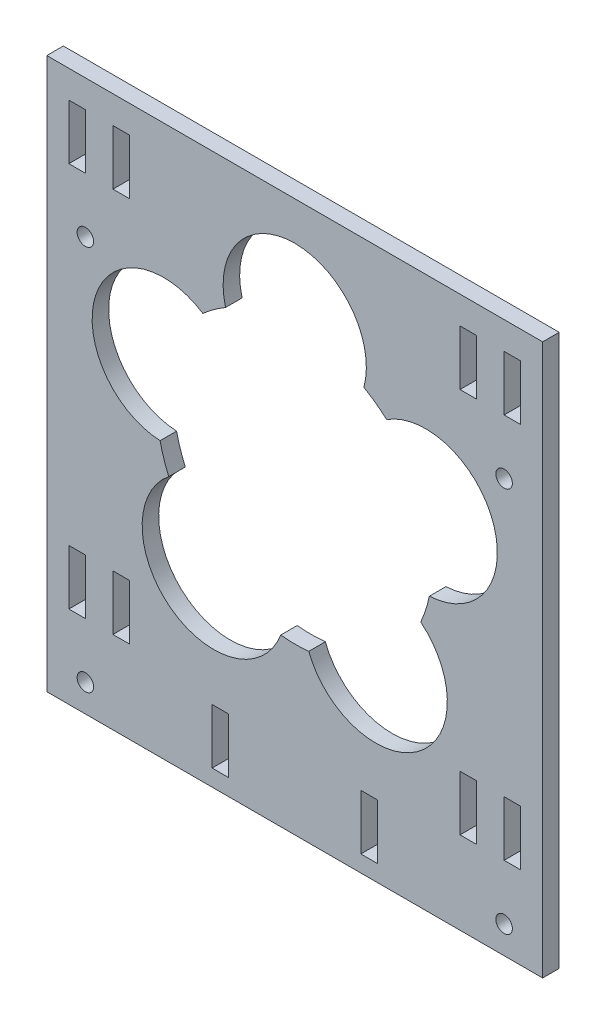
ISO-10303-21;
HEADER;
FILE_DESCRIPTION(('STEP AP214'),'2;1');
FILE_NAME('part.step','',(''),(''),'','','');
FILE_SCHEMA(('AUTOMOTIVE_DESIGN { 1 0 10303 214 1 1 1 1 }'));
ENDSEC;
DATA;
#1=APPLICATION_CONTEXT('core data for automotive mechanical design processes');
#2=APPLICATION_PROTOCOL_DEFINITION('international standard','automotive_design',2000,#1);
#3=PRODUCT_CONTEXT('',#1,'mechanical');
#4=PRODUCT('Part','Part','',(#3));
#5=PRODUCT_RELATED_PRODUCT_CATEGORY('part','',(#4));
#6=PRODUCT_DEFINITION_FORMATION('','',#4);
#7=PRODUCT_DEFINITION_CONTEXT('part definition',#1,'design');
#8=PRODUCT_DEFINITION('design','',#6,#7);
#9=PRODUCT_DEFINITION_SHAPE('','',#8);
#10=(LENGTH_UNIT() NAMED_UNIT(*) SI_UNIT(.MILLI.,.METRE.));
#11=(NAMED_UNIT(*) PLANE_ANGLE_UNIT() SI_UNIT($,.RADIAN.));
#12=(NAMED_UNIT(*) SI_UNIT($,.STERADIAN.) SOLID_ANGLE_UNIT());
#13=UNCERTAINTY_MEASURE_WITH_UNIT(LENGTH_MEASURE(1.E-05),#10,'distance_accuracy_value','');
#14=(GEOMETRIC_REPRESENTATION_CONTEXT(3) GLOBAL_UNCERTAINTY_ASSIGNED_CONTEXT((#13)) GLOBAL_UNIT_ASSIGNED_CONTEXT((#10,
#11,#12)) REPRESENTATION_CONTEXT('',''));
#15=CARTESIAN_POINT('',(0.,0.,0.));
#16=DIRECTION('',(0.,0.,1.));
#17=DIRECTION('',(1.,0.,0.));
#18=AXIS2_PLACEMENT_3D('',#15,#16,#17);
#19=CARTESIAN_POINT('',(44.9999999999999,1.2490009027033E-13,3.));
#20=DIRECTION('',(1.,0.,0.));
#21=DIRECTION('',(0.,1.,0.));
#22=AXIS2_PLACEMENT_3D('',#19,#20,#21);
#23=PLANE('',#22);
#24=DIRECTION('',(0.,-1.,0.));
#25=VECTOR('',#24,1.);
#26=CARTESIAN_POINT('',(44.9999999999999,1.2490009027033E-13,0.));
#27=LINE('',#26,#25);
#28=CARTESIAN_POINT('',(45.,45.,0.));
#29=VERTEX_POINT('',#28);
#30=CARTESIAN_POINT('',(45.,-55.,0.));
#31=VERTEX_POINT('',#30);
#32=EDGE_CURVE('E491',#29,#31,#27,.T.);
#33=ORIENTED_EDGE('',*,*,#32,.F.);
#34=DIRECTION('',(0.,0.,-1.));
#35=VECTOR('',#34,1.);
#36=CARTESIAN_POINT('',(45.,45.,3.));
#37=LINE('',#36,#35);
#38=CARTESIAN_POINT('',(45.,45.,3.));
#39=VERTEX_POINT('',#38);
#40=EDGE_CURVE('E526',#39,#29,#37,.T.);
#41=ORIENTED_EDGE('',*,*,#40,.F.);
#42=DIRECTION('',(0.,-1.,0.));
#43=VECTOR('',#42,1.);
#44=CARTESIAN_POINT('',(44.9999999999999,1.2490009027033E-13,3.));
#45=LINE('',#44,#43);
#46=CARTESIAN_POINT('',(45.,-55.,3.));
#47=VERTEX_POINT('',#46);
#48=EDGE_CURVE('E498',#39,#47,#45,.T.);
#49=ORIENTED_EDGE('',*,*,#48,.T.);
#50=DIRECTION('',(0.,0.,-1.));
#51=VECTOR('',#50,1.);
#52=CARTESIAN_POINT('',(45.,-55.,3.));
#53=LINE('',#52,#51);
#54=EDGE_CURVE('E510',#47,#31,#53,.T.);
#55=ORIENTED_EDGE('',*,*,#54,.T.);
#56=EDGE_LOOP('',(#33,#41,#49,#55));
#57=FACE_BOUND('',#56,.T.);
#58=ADVANCED_FACE('F35',(#57),#23,.T.);
#59=CARTESIAN_POINT('',(0.,45.,3.));
#60=DIRECTION('',(0.,1.,0.));
#61=DIRECTION('',(0.,0.,1.));
#62=AXIS2_PLACEMENT_3D('',#59,#60,#61);
#63=PLANE('',#62);
#64=DIRECTION('',(1.,0.,0.));
#65=VECTOR('',#64,1.);
#66=CARTESIAN_POINT('',(0.,45.,0.));
#67=LINE('',#66,#65);
#68=CARTESIAN_POINT('',(-45.,45.,0.));
#69=VERTEX_POINT('',#68);
#70=EDGE_CURVE('E513',#69,#29,#67,.T.);
#71=ORIENTED_EDGE('',*,*,#70,.F.);
#72=DIRECTION('',(0.,0.,-1.));
#73=VECTOR('',#72,1.);
#74=CARTESIAN_POINT('',(-45.,45.,3.));
#75=LINE('',#74,#73);
#76=CARTESIAN_POINT('',(-45.,45.,3.));
#77=VERTEX_POINT('',#76);
#78=EDGE_CURVE('E524',#77,#69,#75,.T.);
#79=ORIENTED_EDGE('',*,*,#78,.F.);
#80=DIRECTION('',(1.,0.,0.));
#81=VECTOR('',#80,1.);
#82=CARTESIAN_POINT('',(0.,45.,3.));
#83=LINE('',#82,#81);
#84=EDGE_CURVE('E501',#77,#39,#83,.T.);
#85=ORIENTED_EDGE('',*,*,#84,.T.);
#86=ORIENTED_EDGE('',*,*,#40,.T.);
#87=EDGE_LOOP('',(#71,#79,#85,#86));
#88=FACE_BOUND('',#87,.T.);
#89=ADVANCED_FACE('F866',(#88),#63,.T.);
#90=CARTESIAN_POINT('',(-45.,0.,3.));
#91=DIRECTION('',(-1.,0.,0.));
#92=DIRECTION('',(0.,-1.,0.));
#93=AXIS2_PLACEMENT_3D('',#90,#91,#92);
#94=PLANE('',#93);
#95=DIRECTION('',(0.,1.,0.));
#96=VECTOR('',#95,1.);
#97=CARTESIAN_POINT('',(-45.,0.,0.));
#98=LINE('',#97,#96);
#99=CARTESIAN_POINT('',(-45.,-55.,0.));
#100=VERTEX_POINT('',#99);
#101=EDGE_CURVE('E516',#100,#69,#98,.T.);
#102=ORIENTED_EDGE('',*,*,#101,.F.);
#103=DIRECTION('',(0.,0.,-1.));
#104=VECTOR('',#103,1.);
#105=CARTESIAN_POINT('',(-45.,-55.,3.));
#106=LINE('',#105,#104);
#107=CARTESIAN_POINT('',(-45.,-55.,3.));
#108=VERTEX_POINT('',#107);
#109=EDGE_CURVE('E522',#108,#100,#106,.T.);
#110=ORIENTED_EDGE('',*,*,#109,.F.);
#111=DIRECTION('',(0.,1.,0.));
#112=VECTOR('',#111,1.);
#113=CARTESIAN_POINT('',(-45.,0.,3.));
#114=LINE('',#113,#112);
#115=EDGE_CURVE('E505',#108,#77,#114,.T.);
#116=ORIENTED_EDGE('',*,*,#115,.T.);
#117=ORIENTED_EDGE('',*,*,#78,.T.);
#118=EDGE_LOOP('',(#102,#110,#116,#117));
#119=FACE_BOUND('',#118,.T.);
#120=ADVANCED_FACE('F871',(#119),#94,.T.);
#121=CARTESIAN_POINT('',(0.,-55.,3.));
#122=DIRECTION('',(0.,1.,0.));
#123=DIRECTION('',(0.,0.,1.));
#124=AXIS2_PLACEMENT_3D('',#121,#122,#123);
#125=PLANE('',#124);
#126=DIRECTION('',(1.,0.,0.));
#127=VECTOR('',#126,1.);
#128=CARTESIAN_POINT('',(0.,-55.,0.));
#129=LINE('',#128,#127);
#130=EDGE_CURVE('E502',#100,#31,#129,.T.);
#131=ORIENTED_EDGE('',*,*,#130,.T.);
#132=ORIENTED_EDGE('',*,*,#54,.F.);
#133=DIRECTION('',(1.,0.,0.));
#134=VECTOR('',#133,1.);
#135=CARTESIAN_POINT('',(0.,-55.,3.));
#136=LINE('',#135,#134);
#137=EDGE_CURVE('E508',#108,#47,#136,.T.);
#138=ORIENTED_EDGE('',*,*,#137,.F.);
#139=ORIENTED_EDGE('',*,*,#109,.T.);
#140=EDGE_LOOP('',(#131,#132,#138,#139));
#141=FACE_BOUND('',#140,.T.);
#142=ADVANCED_FACE('F886',(#141),#125,.F.);
#143=CARTESIAN_POINT('',(0.,0.,3.));
#144=DIRECTION('',(0.,0.,1.));
#145=DIRECTION('',(1.,0.,0.));
#146=AXIS2_PLACEMENT_3D('',#143,#144,#145);
#147=PLANE('',#146);
#148=CARTESIAN_POINT('',(0.,0.,3.));
#149=DIRECTION('',(0.,0.,1.));
#150=DIRECTION('',(1.,0.,0.));
#151=AXIS2_PLACEMENT_3D('',#148,#149,#150);
#152=CIRCLE('',#151,25.);
#153=CARTESIAN_POINT('',(16.6827787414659,18.6194761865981,3.));
#154=VERTEX_POINT('',#153);
#155=CARTESIAN_POINT('',(12.5529120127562,21.62,3.));
#156=VERTEX_POINT('',#155);
#157=EDGE_CURVE('E375',#154,#156,#152,.T.);
#158=ORIENTED_EDGE('',*,*,#157,.F.);
#159=CARTESIAN_POINT('',(23.7764129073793,7.72542485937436,3.));
#160=DIRECTION('',(0.,0.,1.));
#161=DIRECTION('',(1.,0.,0.));
#162=AXIS2_PLACEMENT_3D('',#159,#160,#161);
#163=CIRCLE('',#162,13.);
#164=CARTESIAN_POINT('',(24.4409050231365,-5.25758134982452,3.));
#165=VERTEX_POINT('',#164);
#166=EDGE_CURVE('E389',#165,#154,#163,.T.);
#167=ORIENTED_EDGE('',*,*,#166,.F.);
#168=CARTESIAN_POINT('',(22.863436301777,-10.1125308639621,3.));
#169=VERTEX_POINT('',#168);
#170=EDGE_CURVE('E396',#169,#165,#152,.T.);
#171=ORIENTED_EDGE('',*,*,#170,.F.);
#172=CARTESIAN_POINT('',(14.6946313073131,-20.2254248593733,3.));
#173=DIRECTION('',(0.,0.,1.));
#174=DIRECTION('',(1.,0.,0.));
#175=AXIS2_PLACEMENT_3D('',#172,#173,#174);
#176=CIRCLE('',#175,13.);
#177=CARTESIAN_POINT('',(2.55239800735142,-24.8693639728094,3.));
#178=VERTEX_POINT('',#177);
#179=EDGE_CURVE('E399',#178,#169,#176,.T.);
#180=ORIENTED_EDGE('',*,*,#179,.F.);
#181=CARTESIAN_POINT('',(-2.55239800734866,-24.8693639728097,3.));
#182=VERTEX_POINT('',#181);
#183=EDGE_CURVE('E1117',#182,#178,#152,.T.);
#184=ORIENTED_EDGE('',*,*,#183,.F.);
#185=CARTESIAN_POINT('',(-14.6946313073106,-20.2254248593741,3.));
#186=DIRECTION('',(0.,0.,1.));
#187=DIRECTION('',(1.,0.,0.));
#188=AXIS2_PLACEMENT_3D('',#185,#186,#187);
#189=CIRCLE('',#188,13.);
#190=CARTESIAN_POINT('',(-22.863436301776,-10.1125308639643,3.));
#191=VERTEX_POINT('',#190);
#192=EDGE_CURVE('E404',#191,#182,#189,.T.);
#193=ORIENTED_EDGE('',*,*,#192,.F.);
#194=CARTESIAN_POINT('',(-24.4409050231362,-5.25758134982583,3.));
#195=VERTEX_POINT('',#194);
#196=EDGE_CURVE('E1113',#195,#191,#152,.T.);
#197=ORIENTED_EDGE('',*,*,#196,.F.);
#198=CARTESIAN_POINT('',(-23.7764129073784,7.72542485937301,3.));
#199=DIRECTION('',(0.,0.,1.));
#200=DIRECTION('',(1.,0.,0.));
#201=AXIS2_PLACEMENT_3D('',#198,#199,#200);
#202=CIRCLE('',#201,13.);
#203=CARTESIAN_POINT('',(-16.6827787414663,18.6194761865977,3.));
#204=VERTEX_POINT('',#203);
#205=EDGE_CURVE('E412',#204,#195,#202,.T.);
#206=ORIENTED_EDGE('',*,*,#205,.F.);
#207=CARTESIAN_POINT('',(-12.5529120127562,21.62,3.));
#208=VERTEX_POINT('',#207);
#209=EDGE_CURVE('E394',#208,#204,#152,.T.);
#210=ORIENTED_EDGE('',*,*,#209,.F.);
#211=CARTESIAN_POINT('',(0.,25.,3.));
#212=DIRECTION('',(0.,0.,1.));
#213=DIRECTION('',(1.,0.,0.));
#214=AXIS2_PLACEMENT_3D('',#211,#212,#213);
#215=CIRCLE('',#214,13.);
#216=EDGE_CURVE('E392',#156,#208,#215,.T.);
#217=ORIENTED_EDGE('',*,*,#216,.F.);
#218=EDGE_LOOP('',(#158,#167,#171,#180,#184,#193,#197,#206,#210,#217));
#219=FACE_BOUND('',#218,.T.);
#220=CARTESIAN_POINT('',(-38.,20.,3.));
#221=DIRECTION('',(0.,0.,1.));
#222=DIRECTION('',(1.,0.,0.));
#223=AXIS2_PLACEMENT_3D('',#220,#221,#222);
#224=CIRCLE('',#223,1.5);
#225=CARTESIAN_POINT('',(-36.5,20.,3.));
#226=VERTEX_POINT('',#225);
#227=EDGE_CURVE('E735',#226,#226,#224,.T.);
#228=ORIENTED_EDGE('',*,*,#227,.F.);
#229=EDGE_LOOP('',(#228));
#230=FACE_BOUND('',#229,.T.);
#231=CARTESIAN_POINT('',(-38.,-50.,3.));
#232=DIRECTION('',(0.,0.,1.));
#233=DIRECTION('',(1.,0.,0.));
#234=AXIS2_PLACEMENT_3D('',#231,#232,#233);
#235=CIRCLE('',#234,1.5);
#236=CARTESIAN_POINT('',(-36.5,-50.,3.));
#237=VERTEX_POINT('',#236);
#238=EDGE_CURVE('E731',#237,#237,#235,.T.);
#239=ORIENTED_EDGE('',*,*,#238,.F.);
#240=EDGE_LOOP('',(#239));
#241=FACE_BOUND('',#240,.T.);
#242=DIRECTION('',(0.,-1.,0.));
#243=VECTOR('',#242,1.);
#244=CARTESIAN_POINT('',(-15.,-52.,3.));
#245=LINE('',#244,#243);
#246=CARTESIAN_POINT('',(-15.,-42.,3.));
#247=VERTEX_POINT('',#246);
#248=CARTESIAN_POINT('',(-15.,-52.,3.));
#249=VERTEX_POINT('',#248);
#250=EDGE_CURVE('E734',#247,#249,#245,.T.);
#251=ORIENTED_EDGE('',*,*,#250,.F.);
#252=DIRECTION('',(-1.,0.,0.));
#253=VECTOR('',#252,1.);
#254=CARTESIAN_POINT('',(-15.,-42.,3.));
#255=LINE('',#254,#253);
#256=CARTESIAN_POINT('',(-12.,-42.,3.));
#257=VERTEX_POINT('',#256);
#258=EDGE_CURVE('E768',#257,#247,#255,.T.);
#259=ORIENTED_EDGE('',*,*,#258,.F.);
#260=DIRECTION('',(0.,1.,0.));
#261=VECTOR('',#260,1.);
#262=CARTESIAN_POINT('',(-12.,-42.,3.));
#263=LINE('',#262,#261);
#264=CARTESIAN_POINT('',(-12.,-52.,3.));
#265=VERTEX_POINT('',#264);
#266=EDGE_CURVE('E765',#265,#257,#263,.T.);
#267=ORIENTED_EDGE('',*,*,#266,.F.);
#268=DIRECTION('',(1.,0.,0.));
#269=VECTOR('',#268,1.);
#270=CARTESIAN_POINT('',(-12.,-52.,3.));
#271=LINE('',#270,#269);
#272=EDGE_CURVE('E762',#249,#265,#271,.T.);
#273=ORIENTED_EDGE('',*,*,#272,.F.);
#274=EDGE_LOOP('',(#251,#259,#267,#273));
#275=FACE_BOUND('',#274,.T.);
#276=DIRECTION('',(-1.,0.,0.));
#277=VECTOR('',#276,1.);
#278=CARTESIAN_POINT('',(-38.,40.,3.));
#279=LINE('',#278,#277);
#280=CARTESIAN_POINT('',(-38.,40.,3.));
#281=VERTEX_POINT('',#280);
#282=CARTESIAN_POINT('',(-41.,40.,3.));
#283=VERTEX_POINT('',#282);
#284=EDGE_CURVE('E739',#281,#283,#279,.T.);
#285=ORIENTED_EDGE('',*,*,#284,.F.);
#286=DIRECTION('',(0.,1.,0.));
#287=VECTOR('',#286,1.);
#288=CARTESIAN_POINT('',(-38.,30.,3.));
#289=LINE('',#288,#287);
#290=CARTESIAN_POINT('',(-38.,30.,3.));
#291=VERTEX_POINT('',#290);
#292=EDGE_CURVE('E748',#291,#281,#289,.T.);
#293=ORIENTED_EDGE('',*,*,#292,.F.);
#294=DIRECTION('',(1.,0.,0.));
#295=VECTOR('',#294,1.);
#296=CARTESIAN_POINT('',(-41.,30.,3.));
#297=LINE('',#296,#295);
#298=CARTESIAN_POINT('',(-41.,30.,3.));
#299=VERTEX_POINT('',#298);
#300=EDGE_CURVE('E745',#299,#291,#297,.T.);
#301=ORIENTED_EDGE('',*,*,#300,.F.);
#302=DIRECTION('',(0.,-1.,0.));
#303=VECTOR('',#302,1.);
#304=CARTESIAN_POINT('',(-41.,40.,3.));
#305=LINE('',#304,#303);
#306=EDGE_CURVE('E741',#283,#299,#305,.T.);
#307=ORIENTED_EDGE('',*,*,#306,.F.);
#308=EDGE_LOOP('',(#285,#293,#301,#307));
#309=FACE_BOUND('',#308,.T.);
#310=DIRECTION('',(0.,-1.,0.));
#311=VECTOR('',#310,1.);
#312=CARTESIAN_POINT('',(38.,30.,3.));
#313=LINE('',#312,#311);
#314=CARTESIAN_POINT('',(38.,40.,3.));
#315=VERTEX_POINT('',#314);
#316=CARTESIAN_POINT('',(38.,30.,3.));
#317=VERTEX_POINT('',#316);
#318=EDGE_CURVE('E724',#315,#317,#313,.T.);
#319=ORIENTED_EDGE('',*,*,#318,.F.);
#320=DIRECTION('',(-1.,0.,0.));
#321=VECTOR('',#320,1.);
#322=CARTESIAN_POINT('',(38.,40.,3.));
#323=LINE('',#322,#321);
#324=CARTESIAN_POINT('',(41.,40.,3.));
#325=VERTEX_POINT('',#324);
#326=EDGE_CURVE('E808',#325,#315,#323,.T.);
#327=ORIENTED_EDGE('',*,*,#326,.F.);
#328=DIRECTION('',(0.,1.,0.));
#329=VECTOR('',#328,1.);
#330=CARTESIAN_POINT('',(41.,40.,3.));
#331=LINE('',#330,#329);
#332=CARTESIAN_POINT('',(41.,30.,3.));
#333=VERTEX_POINT('',#332);
#334=EDGE_CURVE('E805',#333,#325,#331,.T.);
#335=ORIENTED_EDGE('',*,*,#334,.F.);
#336=DIRECTION('',(1.,0.,0.));
#337=VECTOR('',#336,1.);
#338=CARTESIAN_POINT('',(41.,30.,3.));
#339=LINE('',#338,#337);
#340=EDGE_CURVE('E802',#317,#333,#339,.T.);
#341=ORIENTED_EDGE('',*,*,#340,.F.);
#342=EDGE_LOOP('',(#319,#327,#335,#341));
#343=FACE_BOUND('',#342,.T.);
#344=DIRECTION('',(1.,0.,0.));
#345=VECTOR('',#344,1.);
#346=CARTESIAN_POINT('',(12.,-52.,3.));
#347=LINE('',#346,#345);
#348=CARTESIAN_POINT('',(12.,-52.,3.));
#349=VERTEX_POINT('',#348);
#350=CARTESIAN_POINT('',(15.,-52.,3.));
#351=VERTEX_POINT('',#350);
#352=EDGE_CURVE('E779',#349,#351,#347,.T.);
#353=ORIENTED_EDGE('',*,*,#352,.F.);
#354=DIRECTION('',(0.,-1.,0.));
#355=VECTOR('',#354,1.);
#356=CARTESIAN_POINT('',(12.,-42.,3.));
#357=LINE('',#356,#355);
#358=CARTESIAN_POINT('',(12.,-42.,3.));
#359=VERTEX_POINT('',#358);
#360=EDGE_CURVE('E788',#359,#349,#357,.T.);
#361=ORIENTED_EDGE('',*,*,#360,.F.);
#362=DIRECTION('',(-1.,0.,0.));
#363=VECTOR('',#362,1.);
#364=CARTESIAN_POINT('',(15.,-42.,3.));
#365=LINE('',#364,#363);
#366=CARTESIAN_POINT('',(15.,-42.,3.));
#367=VERTEX_POINT('',#366);
#368=EDGE_CURVE('E785',#367,#359,#365,.T.);
#369=ORIENTED_EDGE('',*,*,#368,.F.);
#370=DIRECTION('',(0.,1.,0.));
#371=VECTOR('',#370,1.);
#372=CARTESIAN_POINT('',(15.,-52.,3.));
#373=LINE('',#372,#371);
#374=EDGE_CURVE('E781',#351,#367,#373,.T.);
#375=ORIENTED_EDGE('',*,*,#374,.F.);
#376=EDGE_LOOP('',(#353,#361,#369,#375));
#377=FACE_BOUND('',#376,.T.);
#378=CARTESIAN_POINT('',(38.,-50.,3.));
#379=DIRECTION('',(0.,0.,1.));
#380=DIRECTION('',(-1.,0.,0.));
#381=AXIS2_PLACEMENT_3D('',#378,#379,#380);
#382=CIRCLE('',#381,1.5);
#383=CARTESIAN_POINT('',(36.5,-50.,3.));
#384=VERTEX_POINT('',#383);
#385=EDGE_CURVE('E794',#384,#384,#382,.T.);
#386=ORIENTED_EDGE('',*,*,#385,.F.);
#387=EDGE_LOOP('',(#386));
#388=FACE_BOUND('',#387,.T.);
#389=CARTESIAN_POINT('',(38.,20.,3.));
#390=DIRECTION('',(0.,0.,1.));
#391=DIRECTION('',(-1.,0.,0.));
#392=AXIS2_PLACEMENT_3D('',#389,#390,#391);
#393=CIRCLE('',#392,1.5);
#394=CARTESIAN_POINT('',(36.5,20.,3.));
#395=VERTEX_POINT('',#394);
#396=EDGE_CURVE('E738',#395,#395,#393,.T.);
#397=ORIENTED_EDGE('',*,*,#396,.F.);
#398=EDGE_LOOP('',(#397));
#399=FACE_BOUND('',#398,.T.);
#400=DIRECTION('',(0.,1.,0.));
#401=VECTOR('',#400,1.);
#402=CARTESIAN_POINT('',(41.,-40.,3.));
#403=LINE('',#402,#401);
#404=CARTESIAN_POINT('',(41.,-40.,3.));
#405=VERTEX_POINT('',#404);
#406=CARTESIAN_POINT('',(41.,-30.,3.));
#407=VERTEX_POINT('',#406);
#408=EDGE_CURVE('E707',#405,#407,#403,.T.);
#409=ORIENTED_EDGE('',*,*,#408,.F.);
#410=DIRECTION('',(1.,0.,0.));
#411=VECTOR('',#410,1.);
#412=CARTESIAN_POINT('',(38.,-40.,3.));
#413=LINE('',#412,#411);
#414=CARTESIAN_POINT('',(38.,-40.,3.));
#415=VERTEX_POINT('',#414);
#416=EDGE_CURVE('E718',#415,#405,#413,.T.);
#417=ORIENTED_EDGE('',*,*,#416,.F.);
#418=DIRECTION('',(0.,-1.,0.));
#419=VECTOR('',#418,1.);
#420=CARTESIAN_POINT('',(38.,-30.,3.));
#421=LINE('',#420,#419);
#422=CARTESIAN_POINT('',(38.,-30.,3.));
#423=VERTEX_POINT('',#422);
#424=EDGE_CURVE('E715',#423,#415,#421,.T.);
#425=ORIENTED_EDGE('',*,*,#424,.F.);
#426=DIRECTION('',(-1.,0.,0.));
#427=VECTOR('',#426,1.);
#428=CARTESIAN_POINT('',(41.,-30.,3.));
#429=LINE('',#428,#427);
#430=EDGE_CURVE('E710',#407,#423,#429,.T.);
#431=ORIENTED_EDGE('',*,*,#430,.F.);
#432=EDGE_LOOP('',(#409,#417,#425,#431));
#433=FACE_BOUND('',#432,.T.);
#434=DIRECTION('',(-1.,0.,0.));
#435=VECTOR('',#434,1.);
#436=CARTESIAN_POINT('',(-41.,-30.,3.));
#437=LINE('',#436,#435);
#438=CARTESIAN_POINT('',(-38.,-30.,3.));
#439=VERTEX_POINT('',#438);
#440=CARTESIAN_POINT('',(-41.,-30.,3.));
#441=VERTEX_POINT('',#440);
#442=EDGE_CURVE('E754',#439,#441,#437,.T.);
#443=ORIENTED_EDGE('',*,*,#442,.F.);
#444=DIRECTION('',(0.,1.,0.));
#445=VECTOR('',#444,1.);
#446=CARTESIAN_POINT('',(-38.,-30.,3.));
#447=LINE('',#446,#445);
#448=CARTESIAN_POINT('',(-38.,-40.,3.));
#449=VERTEX_POINT('',#448);
#450=EDGE_CURVE('E830',#449,#439,#447,.T.);
#451=ORIENTED_EDGE('',*,*,#450,.F.);
#452=DIRECTION('',(1.,0.,0.));
#453=VECTOR('',#452,1.);
#454=CARTESIAN_POINT('',(-38.,-40.,3.));
#455=LINE('',#454,#453);
#456=CARTESIAN_POINT('',(-41.,-40.,3.));
#457=VERTEX_POINT('',#456);
#458=EDGE_CURVE('E827',#457,#449,#455,.T.);
#459=ORIENTED_EDGE('',*,*,#458,.F.);
#460=DIRECTION('',(0.,-1.,0.));
#461=VECTOR('',#460,1.);
#462=CARTESIAN_POINT('',(-41.,-40.,3.));
#463=LINE('',#462,#461);
#464=EDGE_CURVE('E824',#441,#457,#463,.T.);
#465=ORIENTED_EDGE('',*,*,#464,.F.);
#466=EDGE_LOOP('',(#443,#451,#459,#465));
#467=FACE_BOUND('',#466,.T.);
#468=DIRECTION('',(-1.,0.,0.));
#469=VECTOR('',#468,1.);
#470=CARTESIAN_POINT('',(33.,40.,3.));
#471=LINE('',#470,#469);
#472=CARTESIAN_POINT('',(33.,40.,3.));
#473=VERTEX_POINT('',#472);
#474=CARTESIAN_POINT('',(30.,40.,3.));
#475=VERTEX_POINT('',#474);
#476=EDGE_CURVE('E438',#473,#475,#471,.T.);
#477=ORIENTED_EDGE('',*,*,#476,.F.);
#478=DIRECTION('',(0.,1.,0.));
#479=VECTOR('',#478,1.);
#480=CARTESIAN_POINT('',(33.,30.,3.));
#481=LINE('',#480,#479);
#482=CARTESIAN_POINT('',(33.,30.,3.));
#483=VERTEX_POINT('',#482);
#484=EDGE_CURVE('E447',#483,#473,#481,.T.);
#485=ORIENTED_EDGE('',*,*,#484,.F.);
#486=DIRECTION('',(1.,0.,0.));
#487=VECTOR('',#486,1.);
#488=CARTESIAN_POINT('',(30.,30.,3.));
#489=LINE('',#488,#487);
#490=CARTESIAN_POINT('',(30.,30.,3.));
#491=VERTEX_POINT('',#490);
#492=EDGE_CURVE('E444',#491,#483,#489,.T.);
#493=ORIENTED_EDGE('',*,*,#492,.F.);
#494=DIRECTION('',(0.,-1.,0.));
#495=VECTOR('',#494,1.);
#496=CARTESIAN_POINT('',(30.,40.,3.));
#497=LINE('',#496,#495);
#498=EDGE_CURVE('E440',#475,#491,#497,.T.);
#499=ORIENTED_EDGE('',*,*,#498,.F.);
#500=EDGE_LOOP('',(#477,#485,#493,#499));
#501=FACE_BOUND('',#500,.T.);
#502=DIRECTION('',(-1.,0.,0.));
#503=VECTOR('',#502,1.);
#504=CARTESIAN_POINT('',(-30.,-30.,3.));
#505=LINE('',#504,#503);
#506=CARTESIAN_POINT('',(-30.,-30.,3.));
#507=VERTEX_POINT('',#506);
#508=CARTESIAN_POINT('',(-33.,-30.,3.));
#509=VERTEX_POINT('',#508);
#510=EDGE_CURVE('E431',#507,#509,#505,.T.);
#511=ORIENTED_EDGE('',*,*,#510,.F.);
#512=DIRECTION('',(0.,1.,0.));
#513=VECTOR('',#512,1.);
#514=CARTESIAN_POINT('',(-30.,-40.,3.));
#515=LINE('',#514,#513);
#516=CARTESIAN_POINT('',(-30.,-40.,3.));
#517=VERTEX_POINT('',#516);
#518=EDGE_CURVE('E467',#517,#507,#515,.T.);
#519=ORIENTED_EDGE('',*,*,#518,.F.);
#520=DIRECTION('',(1.,0.,0.));
#521=VECTOR('',#520,1.);
#522=CARTESIAN_POINT('',(-33.,-40.,3.));
#523=LINE('',#522,#521);
#524=CARTESIAN_POINT('',(-33.,-40.,3.));
#525=VERTEX_POINT('',#524);
#526=EDGE_CURVE('E464',#525,#517,#523,.T.);
#527=ORIENTED_EDGE('',*,*,#526,.F.);
#528=DIRECTION('',(0.,-1.,0.));
#529=VECTOR('',#528,1.);
#530=CARTESIAN_POINT('',(-33.,-30.,3.));
#531=LINE('',#530,#529);
#532=EDGE_CURVE('E461',#509,#525,#531,.T.);
#533=ORIENTED_EDGE('',*,*,#532,.F.);
#534=EDGE_LOOP('',(#511,#519,#527,#533));
#535=FACE_BOUND('',#534,.T.);
#536=DIRECTION('',(-1.,0.,0.));
#537=VECTOR('',#536,1.);
#538=CARTESIAN_POINT('',(33.,-30.,3.));
#539=LINE('',#538,#537);
#540=CARTESIAN_POINT('',(33.,-30.,3.));
#541=VERTEX_POINT('',#540);
#542=CARTESIAN_POINT('',(30.,-30.,3.));
#543=VERTEX_POINT('',#542);
#544=EDGE_CURVE('E416',#541,#543,#539,.T.);
#545=ORIENTED_EDGE('',*,*,#544,.F.);
#546=DIRECTION('',(0.,1.,0.));
#547=VECTOR('',#546,1.);
#548=CARTESIAN_POINT('',(33.,-40.,3.));
#549=LINE('',#548,#547);
#550=CARTESIAN_POINT('',(33.,-40.,3.));
#551=VERTEX_POINT('',#550);
#552=EDGE_CURVE('E425',#551,#541,#549,.T.);
#553=ORIENTED_EDGE('',*,*,#552,.F.);
#554=DIRECTION('',(1.,0.,0.));
#555=VECTOR('',#554,1.);
#556=CARTESIAN_POINT('',(30.,-40.,3.));
#557=LINE('',#556,#555);
#558=CARTESIAN_POINT('',(30.,-40.,3.));
#559=VERTEX_POINT('',#558);
#560=EDGE_CURVE('E422',#559,#551,#557,.T.);
#561=ORIENTED_EDGE('',*,*,#560,.F.);
#562=DIRECTION('',(0.,-1.,0.));
#563=VECTOR('',#562,1.);
#564=CARTESIAN_POINT('',(30.,-30.,3.));
#565=LINE('',#564,#563);
#566=EDGE_CURVE('E418',#543,#559,#565,.T.);
#567=ORIENTED_EDGE('',*,*,#566,.F.);
#568=EDGE_LOOP('',(#545,#553,#561,#567));
#569=FACE_BOUND('',#568,.T.);
#570=DIRECTION('',(-1.,0.,0.));
#571=VECTOR('',#570,1.);
#572=CARTESIAN_POINT('',(-30.,40.,3.));
#573=LINE('',#572,#571);
#574=CARTESIAN_POINT('',(-30.,40.,3.));
#575=VERTEX_POINT('',#574);
#576=CARTESIAN_POINT('',(-33.,40.,3.));
#577=VERTEX_POINT('',#576);
#578=EDGE_CURVE('E453',#575,#577,#573,.T.);
#579=ORIENTED_EDGE('',*,*,#578,.F.);
#580=DIRECTION('',(0.,1.,0.));
#581=VECTOR('',#580,1.);
#582=CARTESIAN_POINT('',(-30.,30.,3.));
#583=LINE('',#582,#581);
#584=CARTESIAN_POINT('',(-30.,30.,3.));
#585=VERTEX_POINT('',#584);
#586=EDGE_CURVE('E485',#585,#575,#583,.T.);
#587=ORIENTED_EDGE('',*,*,#586,.F.);
#588=DIRECTION('',(1.,0.,0.));
#589=VECTOR('',#588,1.);
#590=CARTESIAN_POINT('',(-33.,30.,3.));
#591=LINE('',#590,#589);
#592=CARTESIAN_POINT('',(-33.,30.,3.));
#593=VERTEX_POINT('',#592);
#594=EDGE_CURVE('E482',#593,#585,#591,.T.);
#595=ORIENTED_EDGE('',*,*,#594,.F.);
#596=DIRECTION('',(0.,-1.,0.));
#597=VECTOR('',#596,1.);
#598=CARTESIAN_POINT('',(-33.,40.,3.));
#599=LINE('',#598,#597);
#600=EDGE_CURVE('E479',#577,#593,#599,.T.);
#601=ORIENTED_EDGE('',*,*,#600,.F.);
#602=EDGE_LOOP('',(#579,#587,#595,#601));
#603=FACE_BOUND('',#602,.T.);
#604=ORIENTED_EDGE('',*,*,#48,.F.);
#605=ORIENTED_EDGE('',*,*,#84,.F.);
#606=ORIENTED_EDGE('',*,*,#115,.F.);
#607=ORIENTED_EDGE('',*,*,#137,.T.);
#608=EDGE_LOOP('',(#604,#605,#606,#607));
#609=FACE_BOUND('',#608,.T.);
#610=ADVANCED_FACE('F386',(#219,#230,#241,#275,#309,#343,#377,#388,#399,#433,#467,#501,#535,
#569,#603,#609),#147,.T.);
#611=CARTESIAN_POINT('',(0.,0.,0.));
#612=DIRECTION('',(0.,0.,1.));
#613=DIRECTION('',(1.,0.,0.));
#614=AXIS2_PLACEMENT_3D('',#611,#612,#613);
#615=PLANE('',#614);
#616=CARTESIAN_POINT('',(-38.,20.,0.));
#617=DIRECTION('',(0.,0.,1.));
#618=DIRECTION('',(1.,0.,0.));
#619=AXIS2_PLACEMENT_3D('',#616,#617,#618);
#620=CIRCLE('',#619,1.5);
#621=CARTESIAN_POINT('',(-36.5,20.,0.));
#622=VERTEX_POINT('',#621);
#623=EDGE_CURVE('E414',#622,#622,#620,.T.);
#624=ORIENTED_EDGE('',*,*,#623,.T.);
#625=EDGE_LOOP('',(#624));
#626=FACE_BOUND('',#625,.T.);
#627=CARTESIAN_POINT('',(-38.,-50.,0.));
#628=DIRECTION('',(0.,0.,1.));
#629=DIRECTION('',(1.,0.,0.));
#630=AXIS2_PLACEMENT_3D('',#627,#628,#629);
#631=CIRCLE('',#630,1.5);
#632=CARTESIAN_POINT('',(-36.5,-50.,0.));
#633=VERTEX_POINT('',#632);
#634=EDGE_CURVE('E620',#633,#633,#631,.T.);
#635=ORIENTED_EDGE('',*,*,#634,.T.);
#636=EDGE_LOOP('',(#635));
#637=FACE_BOUND('',#636,.T.);
#638=DIRECTION('',(-1.,0.,0.));
#639=VECTOR('',#638,1.);
#640=CARTESIAN_POINT('',(0.,-42.,0.));
#641=LINE('',#640,#639);
#642=CARTESIAN_POINT('',(-12.,-42.,0.));
#643=VERTEX_POINT('',#642);
#644=CARTESIAN_POINT('',(-15.,-42.,0.));
#645=VERTEX_POINT('',#644);
#646=EDGE_CURVE('E662',#643,#645,#641,.T.);
#647=ORIENTED_EDGE('',*,*,#646,.T.);
#648=DIRECTION('',(0.,-1.,0.));
#649=VECTOR('',#648,1.);
#650=CARTESIAN_POINT('',(-15.,0.,0.));
#651=LINE('',#650,#649);
#652=CARTESIAN_POINT('',(-15.,-52.,0.));
#653=VERTEX_POINT('',#652);
#654=EDGE_CURVE('E665',#645,#653,#651,.T.);
#655=ORIENTED_EDGE('',*,*,#654,.T.);
#656=DIRECTION('',(1.,0.,0.));
#657=VECTOR('',#656,1.);
#658=CARTESIAN_POINT('',(0.,-52.,0.));
#659=LINE('',#658,#657);
#660=CARTESIAN_POINT('',(-12.,-52.,0.));
#661=VERTEX_POINT('',#660);
#662=EDGE_CURVE('E656',#653,#661,#659,.T.);
#663=ORIENTED_EDGE('',*,*,#662,.T.);
#664=DIRECTION('',(0.,1.,0.));
#665=VECTOR('',#664,1.);
#666=CARTESIAN_POINT('',(-12.,0.,0.));
#667=LINE('',#666,#665);
#668=EDGE_CURVE('E659',#661,#643,#667,.T.);
#669=ORIENTED_EDGE('',*,*,#668,.T.);
#670=EDGE_LOOP('',(#647,#655,#663,#669));
#671=FACE_BOUND('',#670,.T.);
#672=DIRECTION('',(0.,1.,0.));
#673=VECTOR('',#672,1.);
#674=CARTESIAN_POINT('',(-38.,0.,0.));
#675=LINE('',#674,#673);
#676=CARTESIAN_POINT('',(-38.,30.,0.));
#677=VERTEX_POINT('',#676);
#678=CARTESIAN_POINT('',(-38.,40.,0.));
#679=VERTEX_POINT('',#678);
#680=EDGE_CURVE('E650',#677,#679,#675,.T.);
#681=ORIENTED_EDGE('',*,*,#680,.T.);
#682=DIRECTION('',(-1.,0.,0.));
#683=VECTOR('',#682,1.);
#684=CARTESIAN_POINT('',(0.,40.,0.));
#685=LINE('',#684,#683);
#686=CARTESIAN_POINT('',(-41.,40.,0.));
#687=VERTEX_POINT('',#686);
#688=EDGE_CURVE('E653',#679,#687,#685,.T.);
#689=ORIENTED_EDGE('',*,*,#688,.T.);
#690=DIRECTION('',(0.,-1.,0.));
#691=VECTOR('',#690,1.);
#692=CARTESIAN_POINT('',(-41.,0.,0.));
#693=LINE('',#692,#691);
#694=CARTESIAN_POINT('',(-41.,30.,0.));
#695=VERTEX_POINT('',#694);
#696=EDGE_CURVE('E644',#687,#695,#693,.T.);
#697=ORIENTED_EDGE('',*,*,#696,.T.);
#698=DIRECTION('',(1.,0.,0.));
#699=VECTOR('',#698,1.);
#700=CARTESIAN_POINT('',(0.,30.,0.));
#701=LINE('',#700,#699);
#702=EDGE_CURVE('E647',#695,#677,#701,.T.);
#703=ORIENTED_EDGE('',*,*,#702,.T.);
#704=EDGE_LOOP('',(#681,#689,#697,#703));
#705=FACE_BOUND('',#704,.T.);
#706=DIRECTION('',(-1.,0.,0.));
#707=VECTOR('',#706,1.);
#708=CARTESIAN_POINT('',(0.,40.,0.));
#709=LINE('',#708,#707);
#710=CARTESIAN_POINT('',(41.,40.,0.));
#711=VERTEX_POINT('',#710);
#712=CARTESIAN_POINT('',(38.,40.,0.));
#713=VERTEX_POINT('',#712);
#714=EDGE_CURVE('E638',#711,#713,#709,.T.);
#715=ORIENTED_EDGE('',*,*,#714,.T.);
#716=DIRECTION('',(0.,-1.,0.));
#717=VECTOR('',#716,1.);
#718=CARTESIAN_POINT('',(38.,0.,0.));
#719=LINE('',#718,#717);
#720=CARTESIAN_POINT('',(38.,30.,0.));
#721=VERTEX_POINT('',#720);
#722=EDGE_CURVE('E641',#713,#721,#719,.T.);
#723=ORIENTED_EDGE('',*,*,#722,.T.);
#724=DIRECTION('',(1.,0.,0.));
#725=VECTOR('',#724,1.);
#726=CARTESIAN_POINT('',(0.,30.,0.));
#727=LINE('',#726,#725);
#728=CARTESIAN_POINT('',(41.,30.,0.));
#729=VERTEX_POINT('',#728);
#730=EDGE_CURVE('E632',#721,#729,#727,.T.);
#731=ORIENTED_EDGE('',*,*,#730,.T.);
#732=DIRECTION('',(0.,1.,0.));
#733=VECTOR('',#732,1.);
#734=CARTESIAN_POINT('',(41.,0.,0.));
#735=LINE('',#734,#733);
#736=EDGE_CURVE('E635',#729,#711,#735,.T.);
#737=ORIENTED_EDGE('',*,*,#736,.T.);
#738=EDGE_LOOP('',(#715,#723,#731,#737));
#739=FACE_BOUND('',#738,.T.);
#740=DIRECTION('',(0.,-1.,0.));
#741=VECTOR('',#740,1.);
#742=CARTESIAN_POINT('',(12.,0.,0.));
#743=LINE('',#742,#741);
#744=CARTESIAN_POINT('',(12.,-42.,0.));
#745=VERTEX_POINT('',#744);
#746=CARTESIAN_POINT('',(12.,-52.,0.));
#747=VERTEX_POINT('',#746);
#748=EDGE_CURVE('E626',#745,#747,#743,.T.);
#749=ORIENTED_EDGE('',*,*,#748,.T.);
#750=DIRECTION('',(1.,0.,0.));
#751=VECTOR('',#750,1.);
#752=CARTESIAN_POINT('',(0.,-52.,0.));
#753=LINE('',#752,#751);
#754=CARTESIAN_POINT('',(15.,-52.,0.));
#755=VERTEX_POINT('',#754);
#756=EDGE_CURVE('E629',#747,#755,#753,.T.);
#757=ORIENTED_EDGE('',*,*,#756,.T.);
#758=DIRECTION('',(0.,1.,0.));
#759=VECTOR('',#758,1.);
#760=CARTESIAN_POINT('',(15.,0.,0.));
#761=LINE('',#760,#759);
#762=CARTESIAN_POINT('',(15.,-42.,0.));
#763=VERTEX_POINT('',#762);
#764=EDGE_CURVE('E612',#755,#763,#761,.T.);
#765=ORIENTED_EDGE('',*,*,#764,.T.);
#766=DIRECTION('',(-1.,0.,0.));
#767=VECTOR('',#766,1.);
#768=CARTESIAN_POINT('',(0.,-42.,0.));
#769=LINE('',#768,#767);
#770=EDGE_CURVE('E623',#763,#745,#769,.T.);
#771=ORIENTED_EDGE('',*,*,#770,.T.);
#772=EDGE_LOOP('',(#749,#757,#765,#771));
#773=FACE_BOUND('',#772,.T.);
#774=CARTESIAN_POINT('',(38.,-50.,0.));
#775=DIRECTION('',(0.,0.,1.));
#776=DIRECTION('',(1.,0.,0.));
#777=AXIS2_PLACEMENT_3D('',#774,#775,#776);
#778=CIRCLE('',#777,1.5);
#779=CARTESIAN_POINT('',(39.5,-50.,0.));
#780=VERTEX_POINT('',#779);
#781=EDGE_CURVE('E616',#780,#780,#778,.T.);
#782=ORIENTED_EDGE('',*,*,#781,.T.);
#783=EDGE_LOOP('',(#782));
#784=FACE_BOUND('',#783,.T.);
#785=CARTESIAN_POINT('',(38.,20.,0.));
#786=DIRECTION('',(0.,0.,1.));
#787=DIRECTION('',(1.,0.,0.));
#788=AXIS2_PLACEMENT_3D('',#785,#786,#787);
#789=CIRCLE('',#788,1.5);
#790=CARTESIAN_POINT('',(39.5,20.,0.));
#791=VERTEX_POINT('',#790);
#792=EDGE_CURVE('E613',#791,#791,#789,.T.);
#793=ORIENTED_EDGE('',*,*,#792,.T.);
#794=EDGE_LOOP('',(#793));
#795=FACE_BOUND('',#794,.T.);
#796=DIRECTION('',(1.,0.,0.));
#797=VECTOR('',#796,1.);
#798=CARTESIAN_POINT('',(0.,-39.9999999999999,0.));
#799=LINE('',#798,#797);
#800=CARTESIAN_POINT('',(38.,-40.,0.));
#801=VERTEX_POINT('',#800);
#802=CARTESIAN_POINT('',(41.,-40.,0.));
#803=VERTEX_POINT('',#802);
#804=EDGE_CURVE('E606',#801,#803,#799,.T.);
#805=ORIENTED_EDGE('',*,*,#804,.T.);
#806=DIRECTION('',(0.,1.,0.));
#807=VECTOR('',#806,1.);
#808=CARTESIAN_POINT('',(40.9999999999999,0.,0.));
#809=LINE('',#808,#807);
#810=CARTESIAN_POINT('',(41.,-30.,0.));
#811=VERTEX_POINT('',#810);
#812=EDGE_CURVE('E609',#803,#811,#809,.T.);
#813=ORIENTED_EDGE('',*,*,#812,.T.);
#814=DIRECTION('',(-1.,0.,0.));
#815=VECTOR('',#814,1.);
#816=CARTESIAN_POINT('',(0.,-30.,0.));
#817=LINE('',#816,#815);
#818=CARTESIAN_POINT('',(38.,-30.,0.));
#819=VERTEX_POINT('',#818);
#820=EDGE_CURVE('E600',#811,#819,#817,.T.);
#821=ORIENTED_EDGE('',*,*,#820,.T.);
#822=DIRECTION('',(0.,-1.,0.));
#823=VECTOR('',#822,1.);
#824=CARTESIAN_POINT('',(38.,0.,0.));
#825=LINE('',#824,#823);
#826=EDGE_CURVE('E603',#819,#801,#825,.T.);
#827=ORIENTED_EDGE('',*,*,#826,.T.);
#828=EDGE_LOOP('',(#805,#813,#821,#827));
#829=FACE_BOUND('',#828,.T.);
#830=DIRECTION('',(0.,1.,0.));
#831=VECTOR('',#830,1.);
#832=CARTESIAN_POINT('',(-38.,0.,0.));
#833=LINE('',#832,#831);
#834=CARTESIAN_POINT('',(-38.,-40.,0.));
#835=VERTEX_POINT('',#834);
#836=CARTESIAN_POINT('',(-38.,-30.,0.));
#837=VERTEX_POINT('',#836);
#838=EDGE_CURVE('E594',#835,#837,#833,.T.);
#839=ORIENTED_EDGE('',*,*,#838,.T.);
#840=DIRECTION('',(-1.,0.,0.));
#841=VECTOR('',#840,1.);
#842=CARTESIAN_POINT('',(0.,-30.,0.));
#843=LINE('',#842,#841);
#844=CARTESIAN_POINT('',(-41.,-30.,0.));
#845=VERTEX_POINT('',#844);
#846=EDGE_CURVE('E597',#837,#845,#843,.T.);
#847=ORIENTED_EDGE('',*,*,#846,.T.);
#848=DIRECTION('',(0.,-1.,0.));
#849=VECTOR('',#848,1.);
#850=CARTESIAN_POINT('',(-41.,0.,0.));
#851=LINE('',#850,#849);
#852=CARTESIAN_POINT('',(-41.,-40.,0.));
#853=VERTEX_POINT('',#852);
#854=EDGE_CURVE('E576',#845,#853,#851,.T.);
#855=ORIENTED_EDGE('',*,*,#854,.T.);
#856=DIRECTION('',(1.,0.,0.));
#857=VECTOR('',#856,1.);
#858=CARTESIAN_POINT('',(0.,-39.9999999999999,0.));
#859=LINE('',#858,#857);
#860=EDGE_CURVE('E591',#853,#835,#859,.T.);
#861=ORIENTED_EDGE('',*,*,#860,.T.);
#862=EDGE_LOOP('',(#839,#847,#855,#861));
#863=FACE_BOUND('',#862,.T.);
#864=CARTESIAN_POINT('',(23.7764129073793,7.72542485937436,0.));
#865=DIRECTION('',(0.,0.,1.));
#866=DIRECTION('',(1.,0.,0.));
#867=AXIS2_PLACEMENT_3D('',#864,#865,#866);
#868=CIRCLE('',#867,13.);
#869=CARTESIAN_POINT('',(24.4409050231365,-5.25758134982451,0.));
#870=VERTEX_POINT('',#869);
#871=CARTESIAN_POINT('',(16.6827787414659,18.6194761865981,0.));
#872=VERTEX_POINT('',#871);
#873=EDGE_CURVE('E579',#870,#872,#868,.T.);
#874=ORIENTED_EDGE('',*,*,#873,.T.);
#875=CARTESIAN_POINT('',(0.,0.,0.));
#876=DIRECTION('',(0.,0.,1.));
#877=DIRECTION('',(1.,0.,0.));
#878=AXIS2_PLACEMENT_3D('',#875,#876,#877);
#879=CIRCLE('',#878,25.);
#880=CARTESIAN_POINT('',(12.5529120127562,21.62,0.));
#881=VERTEX_POINT('',#880);
#882=EDGE_CURVE('E49',#872,#881,#879,.T.);
#883=ORIENTED_EDGE('',*,*,#882,.T.);
#884=CARTESIAN_POINT('',(0.,25.,0.));
#885=DIRECTION('',(0.,0.,1.));
#886=DIRECTION('',(1.,0.,0.));
#887=AXIS2_PLACEMENT_3D('',#884,#885,#886);
#888=CIRCLE('',#887,13.);
#889=CARTESIAN_POINT('',(-12.5529120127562,21.62,0.));
#890=VERTEX_POINT('',#889);
#891=EDGE_CURVE('E401',#881,#890,#888,.T.);
#892=ORIENTED_EDGE('',*,*,#891,.T.);
#893=CARTESIAN_POINT('',(-16.6827787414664,18.6194761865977,0.));
#894=VERTEX_POINT('',#893);
#895=EDGE_CURVE('E684',#890,#894,#879,.T.);
#896=ORIENTED_EDGE('',*,*,#895,.T.);
#897=CARTESIAN_POINT('',(-23.7764129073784,7.72542485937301,0.));
#898=DIRECTION('',(0.,0.,1.));
#899=DIRECTION('',(1.,0.,0.));
#900=AXIS2_PLACEMENT_3D('',#897,#898,#899);
#901=CIRCLE('',#900,13.);
#902=CARTESIAN_POINT('',(-24.4409050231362,-5.25758134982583,0.));
#903=VERTEX_POINT('',#902);
#904=EDGE_CURVE('E419',#894,#903,#901,.T.);
#905=ORIENTED_EDGE('',*,*,#904,.T.);
#906=CARTESIAN_POINT('',(-22.863436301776,-10.1125308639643,0.));
#907=VERTEX_POINT('',#906);
#908=EDGE_CURVE('E393',#903,#907,#879,.T.);
#909=ORIENTED_EDGE('',*,*,#908,.T.);
#910=CARTESIAN_POINT('',(-14.6946313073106,-20.2254248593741,0.));
#911=DIRECTION('',(0.,0.,1.));
#912=DIRECTION('',(1.,0.,0.));
#913=AXIS2_PLACEMENT_3D('',#910,#911,#912);
#914=CIRCLE('',#913,13.);
#915=CARTESIAN_POINT('',(-2.55239800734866,-24.8693639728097,0.));
#916=VERTEX_POINT('',#915);
#917=EDGE_CURVE('E584',#907,#916,#914,.T.);
#918=ORIENTED_EDGE('',*,*,#917,.T.);
#919=CARTESIAN_POINT('',(2.55239800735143,-24.8693639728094,0.));
#920=VERTEX_POINT('',#919);
#921=EDGE_CURVE('E691',#916,#920,#879,.T.);
#922=ORIENTED_EDGE('',*,*,#921,.T.);
#923=CARTESIAN_POINT('',(14.6946313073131,-20.2254248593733,0.));
#924=DIRECTION('',(0.,0.,1.));
#925=DIRECTION('',(1.,0.,0.));
#926=AXIS2_PLACEMENT_3D('',#923,#924,#925);
#927=CIRCLE('',#926,13.);
#928=CARTESIAN_POINT('',(22.863436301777,-10.1125308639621,0.));
#929=VERTEX_POINT('',#928);
#930=EDGE_CURVE('E581',#920,#929,#927,.T.);
#931=ORIENTED_EDGE('',*,*,#930,.T.);
#932=EDGE_CURVE('E57',#929,#870,#879,.T.);
#933=ORIENTED_EDGE('',*,*,#932,.T.);
#934=EDGE_LOOP('',(#874,#883,#892,#896,#905,#909,#918,#922,#931,#933));
#935=FACE_BOUND('',#934,.T.);
#936=DIRECTION('',(0.,1.,0.));
#937=VECTOR('',#936,1.);
#938=CARTESIAN_POINT('',(33.,0.,0.));
#939=LINE('',#938,#937);
#940=CARTESIAN_POINT('',(33.,30.,0.));
#941=VERTEX_POINT('',#940);
#942=CARTESIAN_POINT('',(33.,40.,0.));
#943=VERTEX_POINT('',#942);
#944=EDGE_CURVE('E570',#941,#943,#939,.T.);
#945=ORIENTED_EDGE('',*,*,#944,.T.);
#946=DIRECTION('',(-1.,0.,0.));
#947=VECTOR('',#946,1.);
#948=CARTESIAN_POINT('',(0.,40.,0.));
#949=LINE('',#948,#947);
#950=CARTESIAN_POINT('',(30.,40.,0.));
#951=VERTEX_POINT('',#950);
#952=EDGE_CURVE('E573',#943,#951,#949,.T.);
#953=ORIENTED_EDGE('',*,*,#952,.T.);
#954=DIRECTION('',(0.,-1.,0.));
#955=VECTOR('',#954,1.);
#956=CARTESIAN_POINT('',(30.,0.,0.));
#957=LINE('',#956,#955);
#958=CARTESIAN_POINT('',(30.,30.,0.));
#959=VERTEX_POINT('',#958);
#960=EDGE_CURVE('E564',#951,#959,#957,.T.);
#961=ORIENTED_EDGE('',*,*,#960,.T.);
#962=DIRECTION('',(1.,0.,0.));
#963=VECTOR('',#962,1.);
#964=CARTESIAN_POINT('',(0.,30.,0.));
#965=LINE('',#964,#963);
#966=EDGE_CURVE('E567',#959,#941,#965,.T.);
#967=ORIENTED_EDGE('',*,*,#966,.T.);
#968=EDGE_LOOP('',(#945,#953,#961,#967));
#969=FACE_BOUND('',#968,.T.);
#970=DIRECTION('',(0.,1.,0.));
#971=VECTOR('',#970,1.);
#972=CARTESIAN_POINT('',(-30.,0.,0.));
#973=LINE('',#972,#971);
#974=CARTESIAN_POINT('',(-30.,-40.,0.));
#975=VERTEX_POINT('',#974);
#976=CARTESIAN_POINT('',(-30.,-30.,0.));
#977=VERTEX_POINT('',#976);
#978=EDGE_CURVE('E558',#975,#977,#973,.T.);
#979=ORIENTED_EDGE('',*,*,#978,.T.);
#980=DIRECTION('',(-1.,0.,0.));
#981=VECTOR('',#980,1.);
#982=CARTESIAN_POINT('',(0.,-30.,0.));
#983=LINE('',#982,#981);
#984=CARTESIAN_POINT('',(-33.,-30.,0.));
#985=VERTEX_POINT('',#984);
#986=EDGE_CURVE('E561',#977,#985,#983,.T.);
#987=ORIENTED_EDGE('',*,*,#986,.T.);
#988=DIRECTION('',(0.,-1.,0.));
#989=VECTOR('',#988,1.);
#990=CARTESIAN_POINT('',(-33.,0.,0.));
#991=LINE('',#990,#989);
#992=CARTESIAN_POINT('',(-33.,-40.,0.));
#993=VERTEX_POINT('',#992);
#994=EDGE_CURVE('E552',#985,#993,#991,.T.);
#995=ORIENTED_EDGE('',*,*,#994,.T.);
#996=DIRECTION('',(1.,0.,0.));
#997=VECTOR('',#996,1.);
#998=CARTESIAN_POINT('',(0.,-40.,0.));
#999=LINE('',#998,#997);
#1000=EDGE_CURVE('E555',#993,#975,#999,.T.);
#1001=ORIENTED_EDGE('',*,*,#1000,.T.);
#1002=EDGE_LOOP('',(#979,#987,#995,#1001));
#1003=FACE_BOUND('',#1002,.T.);
#1004=DIRECTION('',(0.,1.,0.));
#1005=VECTOR('',#1004,1.);
#1006=CARTESIAN_POINT('',(33.,0.,0.));
#1007=LINE('',#1006,#1005);
#1008=CARTESIAN_POINT('',(33.,-40.,0.));
#1009=VERTEX_POINT('',#1008);
#1010=CARTESIAN_POINT('',(33.,-30.,0.));
#1011=VERTEX_POINT('',#1010);
#1012=EDGE_CURVE('E546',#1009,#1011,#1007,.T.);
#1013=ORIENTED_EDGE('',*,*,#1012,.T.);
#1014=DIRECTION('',(-1.,0.,0.));
#1015=VECTOR('',#1014,1.);
#1016=CARTESIAN_POINT('',(0.,-30.,0.));
#1017=LINE('',#1016,#1015);
#1018=CARTESIAN_POINT('',(30.,-30.,0.));
#1019=VERTEX_POINT('',#1018);
#1020=EDGE_CURVE('E549',#1011,#1019,#1017,.T.);
#1021=ORIENTED_EDGE('',*,*,#1020,.T.);
#1022=DIRECTION('',(0.,-1.,0.));
#1023=VECTOR('',#1022,1.);
#1024=CARTESIAN_POINT('',(30.,0.,0.));
#1025=LINE('',#1024,#1023);
#1026=CARTESIAN_POINT('',(30.,-40.,0.));
#1027=VERTEX_POINT('',#1026);
#1028=EDGE_CURVE('E540',#1019,#1027,#1025,.T.);
#1029=ORIENTED_EDGE('',*,*,#1028,.T.);
#1030=DIRECTION('',(1.,0.,0.));
#1031=VECTOR('',#1030,1.);
#1032=CARTESIAN_POINT('',(0.,-39.9999999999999,0.));
#1033=LINE('',#1032,#1031);
#1034=EDGE_CURVE('E543',#1027,#1009,#1033,.T.);
#1035=ORIENTED_EDGE('',*,*,#1034,.T.);
#1036=EDGE_LOOP('',(#1013,#1021,#1029,#1035));
#1037=FACE_BOUND('',#1036,.T.);
#1038=DIRECTION('',(0.,1.,0.));
#1039=VECTOR('',#1038,1.);
#1040=CARTESIAN_POINT('',(-30.,0.,0.));
#1041=LINE('',#1040,#1039);
#1042=CARTESIAN_POINT('',(-30.,30.,0.));
#1043=VERTEX_POINT('',#1042);
#1044=CARTESIAN_POINT('',(-30.,40.,0.));
#1045=VERTEX_POINT('',#1044);
#1046=EDGE_CURVE('E534',#1043,#1045,#1041,.T.);
#1047=ORIENTED_EDGE('',*,*,#1046,.T.);
#1048=DIRECTION('',(-1.,0.,0.));
#1049=VECTOR('',#1048,1.);
#1050=CARTESIAN_POINT('',(0.,40.,0.));
#1051=LINE('',#1050,#1049);
#1052=CARTESIAN_POINT('',(-33.,40.,0.));
#1053=VERTEX_POINT('',#1052);
#1054=EDGE_CURVE('E537',#1045,#1053,#1051,.T.);
#1055=ORIENTED_EDGE('',*,*,#1054,.T.);
#1056=DIRECTION('',(0.,-1.,0.));
#1057=VECTOR('',#1056,1.);
#1058=CARTESIAN_POINT('',(-33.,0.,0.));
#1059=LINE('',#1058,#1057);
#1060=CARTESIAN_POINT('',(-33.,30.,0.));
#1061=VERTEX_POINT('',#1060);
#1062=EDGE_CURVE('E528',#1053,#1061,#1059,.T.);
#1063=ORIENTED_EDGE('',*,*,#1062,.T.);
#1064=DIRECTION('',(1.,0.,0.));
#1065=VECTOR('',#1064,1.);
#1066=CARTESIAN_POINT('',(0.,30.,0.));
#1067=LINE('',#1066,#1065);
#1068=EDGE_CURVE('E531',#1061,#1043,#1067,.T.);
#1069=ORIENTED_EDGE('',*,*,#1068,.T.);
#1070=EDGE_LOOP('',(#1047,#1055,#1063,#1069));
#1071=FACE_BOUND('',#1070,.T.);
#1072=ORIENTED_EDGE('',*,*,#32,.T.);
#1073=ORIENTED_EDGE('',*,*,#130,.F.);
#1074=ORIENTED_EDGE('',*,*,#101,.T.);
#1075=ORIENTED_EDGE('',*,*,#70,.T.);
#1076=EDGE_LOOP('',(#1072,#1073,#1074,#1075));
#1077=FACE_BOUND('',#1076,.T.);
#1078=ADVANCED_FACE('F681',(#626,#637,#671,#705,#739,#773,#784,#795,#829,#863,#935,#969,#1003,
#1037,#1071,#1077),#615,.F.);
#1079=CARTESIAN_POINT('',(-30.,40.,-7.));
#1080=DIRECTION('',(0.,1.,0.));
#1081=DIRECTION('',(0.,0.,1.));
#1082=AXIS2_PLACEMENT_3D('',#1079,#1080,#1081);
#1083=PLANE('',#1082);
#1084=DIRECTION('',(0.,0.,1.));
#1085=VECTOR('',#1084,1.);
#1086=CARTESIAN_POINT('',(-30.,40.,-7.));
#1087=LINE('',#1086,#1085);
#1088=EDGE_CURVE('E489',#1045,#575,#1087,.T.);
#1089=ORIENTED_EDGE('',*,*,#1088,.T.);
#1090=ORIENTED_EDGE('',*,*,#578,.T.);
#1091=DIRECTION('',(0.,0.,1.));
#1092=VECTOR('',#1091,1.);
#1093=CARTESIAN_POINT('',(-33.,40.,-7.));
#1094=LINE('',#1093,#1092);
#1095=EDGE_CURVE('E488',#1053,#577,#1094,.T.);
#1096=ORIENTED_EDGE('',*,*,#1095,.F.);
#1097=ORIENTED_EDGE('',*,*,#1054,.F.);
#1098=EDGE_LOOP('',(#1089,#1090,#1096,#1097));
#1099=FACE_BOUND('',#1098,.T.);
#1100=ADVANCED_FACE('F897',(#1099),#1083,.F.);
#1101=CARTESIAN_POINT('',(-30.,30.,-7.));
#1102=DIRECTION('',(1.,0.,0.));
#1103=DIRECTION('',(0.,0.,-1.));
#1104=AXIS2_PLACEMENT_3D('',#1101,#1102,#1103);
#1105=PLANE('',#1104);
#1106=DIRECTION('',(0.,0.,1.));
#1107=VECTOR('',#1106,1.);
#1108=CARTESIAN_POINT('',(-30.,30.,-7.));
#1109=LINE('',#1108,#1107);
#1110=EDGE_CURVE('E492',#1043,#585,#1109,.T.);
#1111=ORIENTED_EDGE('',*,*,#1110,.T.);
#1112=ORIENTED_EDGE('',*,*,#586,.T.);
#1113=ORIENTED_EDGE('',*,*,#1088,.F.);
#1114=ORIENTED_EDGE('',*,*,#1046,.F.);
#1115=EDGE_LOOP('',(#1111,#1112,#1113,#1114));
#1116=FACE_BOUND('',#1115,.T.);
#1117=ADVANCED_FACE('F902',(#1116),#1105,.F.);
#1118=CARTESIAN_POINT('',(-33.,30.,-7.));
#1119=DIRECTION('',(0.,-1.,0.));
#1120=DIRECTION('',(0.,0.,-1.));
#1121=AXIS2_PLACEMENT_3D('',#1118,#1119,#1120);
#1122=PLANE('',#1121);
#1123=DIRECTION('',(0.,0.,1.));
#1124=VECTOR('',#1123,1.);
#1125=CARTESIAN_POINT('',(-33.,30.,-7.));
#1126=LINE('',#1125,#1124);
#1127=EDGE_CURVE('E494',#1061,#593,#1126,.T.);
#1128=ORIENTED_EDGE('',*,*,#1127,.T.);
#1129=ORIENTED_EDGE('',*,*,#594,.T.);
#1130=ORIENTED_EDGE('',*,*,#1110,.F.);
#1131=ORIENTED_EDGE('',*,*,#1068,.F.);
#1132=EDGE_LOOP('',(#1128,#1129,#1130,#1131));
#1133=FACE_BOUND('',#1132,.T.);
#1134=ADVANCED_FACE('F908',(#1133),#1122,.F.);
#1135=CARTESIAN_POINT('',(-33.,40.,-7.));
#1136=DIRECTION('',(-1.,0.,0.));
#1137=DIRECTION('',(0.,0.,1.));
#1138=AXIS2_PLACEMENT_3D('',#1135,#1136,#1137);
#1139=PLANE('',#1138);
#1140=ORIENTED_EDGE('',*,*,#1095,.T.);
#1141=ORIENTED_EDGE('',*,*,#600,.T.);
#1142=ORIENTED_EDGE('',*,*,#1127,.F.);
#1143=ORIENTED_EDGE('',*,*,#1062,.F.);
#1144=EDGE_LOOP('',(#1140,#1141,#1142,#1143));
#1145=FACE_BOUND('',#1144,.T.);
#1146=ADVANCED_FACE('F904',(#1145),#1139,.F.);
#1147=CARTESIAN_POINT('',(33.,-30.,-7.));
#1148=DIRECTION('',(0.,1.,0.));
#1149=DIRECTION('',(0.,0.,1.));
#1150=AXIS2_PLACEMENT_3D('',#1147,#1148,#1149);
#1151=PLANE('',#1150);
#1152=DIRECTION('',(0.,0.,1.));
#1153=VECTOR('',#1152,1.);
#1154=CARTESIAN_POINT('',(33.,-30.,-7.));
#1155=LINE('',#1154,#1153);
#1156=EDGE_CURVE('E429',#1011,#541,#1155,.T.);
#1157=ORIENTED_EDGE('',*,*,#1156,.T.);
#1158=ORIENTED_EDGE('',*,*,#544,.T.);
#1159=DIRECTION('',(0.,0.,1.));
#1160=VECTOR('',#1159,1.);
#1161=CARTESIAN_POINT('',(30.,-30.,-7.));
#1162=LINE('',#1161,#1160);
#1163=EDGE_CURVE('E428',#1019,#543,#1162,.T.);
#1164=ORIENTED_EDGE('',*,*,#1163,.F.);
#1165=ORIENTED_EDGE('',*,*,#1020,.F.);
#1166=EDGE_LOOP('',(#1157,#1158,#1164,#1165));
#1167=FACE_BOUND('',#1166,.T.);
#1168=ADVANCED_FACE('F907',(#1167),#1151,.F.);
#1169=CARTESIAN_POINT('',(33.,-40.,-7.));
#1170=DIRECTION('',(1.,0.,0.));
#1171=DIRECTION('',(0.,0.,-1.));
#1172=AXIS2_PLACEMENT_3D('',#1169,#1170,#1171);
#1173=PLANE('',#1172);
#1174=DIRECTION('',(0.,0.,1.));
#1175=VECTOR('',#1174,1.);
#1176=CARTESIAN_POINT('',(33.,-40.,-7.));
#1177=LINE('',#1176,#1175);
#1178=EDGE_CURVE('E432',#1009,#551,#1177,.T.);
#1179=ORIENTED_EDGE('',*,*,#1178,.T.);
#1180=ORIENTED_EDGE('',*,*,#552,.T.);
#1181=ORIENTED_EDGE('',*,*,#1156,.F.);
#1182=ORIENTED_EDGE('',*,*,#1012,.F.);
#1183=EDGE_LOOP('',(#1179,#1180,#1181,#1182));
#1184=FACE_BOUND('',#1183,.T.);
#1185=ADVANCED_FACE('F952',(#1184),#1173,.F.);
#1186=CARTESIAN_POINT('',(30.,-40.,-7.));
#1187=DIRECTION('',(0.,-1.,0.));
#1188=DIRECTION('',(1.,0.,0.));
#1189=AXIS2_PLACEMENT_3D('',#1186,#1187,#1188);
#1190=PLANE('',#1189);
#1191=DIRECTION('',(0.,0.,1.));
#1192=VECTOR('',#1191,1.);
#1193=CARTESIAN_POINT('',(30.,-40.,-7.));
#1194=LINE('',#1193,#1192);
#1195=EDGE_CURVE('E434',#1027,#559,#1194,.T.);
#1196=ORIENTED_EDGE('',*,*,#1195,.T.);
#1197=ORIENTED_EDGE('',*,*,#560,.T.);
#1198=ORIENTED_EDGE('',*,*,#1178,.F.);
#1199=ORIENTED_EDGE('',*,*,#1034,.F.);
#1200=EDGE_LOOP('',(#1196,#1197,#1198,#1199));
#1201=FACE_BOUND('',#1200,.T.);
#1202=ADVANCED_FACE('F956',(#1201),#1190,.F.);
#1203=CARTESIAN_POINT('',(30.,-30.,-7.));
#1204=DIRECTION('',(-1.,0.,0.));
#1205=DIRECTION('',(0.,0.,1.));
#1206=AXIS2_PLACEMENT_3D('',#1203,#1204,#1205);
#1207=PLANE('',#1206);
#1208=ORIENTED_EDGE('',*,*,#1163,.T.);
#1209=ORIENTED_EDGE('',*,*,#566,.T.);
#1210=ORIENTED_EDGE('',*,*,#1195,.F.);
#1211=ORIENTED_EDGE('',*,*,#1028,.F.);
#1212=EDGE_LOOP('',(#1208,#1209,#1210,#1211));
#1213=FACE_BOUND('',#1212,.T.);
#1214=ADVANCED_FACE('F920',(#1213),#1207,.F.);
#1215=CARTESIAN_POINT('',(-30.,-30.,-7.));
#1216=DIRECTION('',(0.,1.,0.));
#1217=DIRECTION('',(-1.,0.,0.));
#1218=AXIS2_PLACEMENT_3D('',#1215,#1216,#1217);
#1219=PLANE('',#1218);
#1220=DIRECTION('',(0.,0.,1.));
#1221=VECTOR('',#1220,1.);
#1222=CARTESIAN_POINT('',(-30.,-30.,-7.));
#1223=LINE('',#1222,#1221);
#1224=EDGE_CURVE('E441',#977,#507,#1223,.T.);
#1225=ORIENTED_EDGE('',*,*,#1224,.T.);
#1226=ORIENTED_EDGE('',*,*,#510,.T.);
#1227=DIRECTION('',(0.,0.,1.));
#1228=VECTOR('',#1227,1.);
#1229=CARTESIAN_POINT('',(-33.,-30.,-7.));
#1230=LINE('',#1229,#1228);
#1231=EDGE_CURVE('E470',#985,#509,#1230,.T.);
#1232=ORIENTED_EDGE('',*,*,#1231,.F.);
#1233=ORIENTED_EDGE('',*,*,#986,.F.);
#1234=EDGE_LOOP('',(#1225,#1226,#1232,#1233));
#1235=FACE_BOUND('',#1234,.T.);
#1236=ADVANCED_FACE('F916',(#1235),#1219,.F.);
#1237=CARTESIAN_POINT('',(-30.,-40.,-7.));
#1238=DIRECTION('',(1.,0.,0.));
#1239=DIRECTION('',(0.,1.,0.));
#1240=AXIS2_PLACEMENT_3D('',#1237,#1238,#1239);
#1241=PLANE('',#1240);
#1242=DIRECTION('',(0.,0.,1.));
#1243=VECTOR('',#1242,1.);
#1244=CARTESIAN_POINT('',(-30.,-40.,-7.));
#1245=LINE('',#1244,#1243);
#1246=EDGE_CURVE('E472',#975,#517,#1245,.T.);
#1247=ORIENTED_EDGE('',*,*,#1246,.T.);
#1248=ORIENTED_EDGE('',*,*,#518,.T.);
#1249=ORIENTED_EDGE('',*,*,#1224,.F.);
#1250=ORIENTED_EDGE('',*,*,#978,.F.);
#1251=EDGE_LOOP('',(#1247,#1248,#1249,#1250));
#1252=FACE_BOUND('',#1251,.T.);
#1253=ADVANCED_FACE('F919',(#1252),#1241,.F.);
#1254=CARTESIAN_POINT('',(-33.,-40.,-7.));
#1255=DIRECTION('',(0.,-1.,0.));
#1256=DIRECTION('',(0.,0.,-1.));
#1257=AXIS2_PLACEMENT_3D('',#1254,#1255,#1256);
#1258=PLANE('',#1257);
#1259=DIRECTION('',(0.,0.,1.));
#1260=VECTOR('',#1259,1.);
#1261=CARTESIAN_POINT('',(-33.,-40.,-7.));
#1262=LINE('',#1261,#1260);
#1263=EDGE_CURVE('E474',#993,#525,#1262,.T.);
#1264=ORIENTED_EDGE('',*,*,#1263,.T.);
#1265=ORIENTED_EDGE('',*,*,#526,.T.);
#1266=ORIENTED_EDGE('',*,*,#1246,.F.);
#1267=ORIENTED_EDGE('',*,*,#1000,.F.);
#1268=EDGE_LOOP('',(#1264,#1265,#1266,#1267));
#1269=FACE_BOUND('',#1268,.T.);
#1270=ADVANCED_FACE('F926',(#1269),#1258,.F.);
#1271=CARTESIAN_POINT('',(-33.,-30.,-7.));
#1272=DIRECTION('',(-1.,0.,0.));
#1273=DIRECTION('',(0.,-1.,0.));
#1274=AXIS2_PLACEMENT_3D('',#1271,#1272,#1273);
#1275=PLANE('',#1274);
#1276=ORIENTED_EDGE('',*,*,#1231,.T.);
#1277=ORIENTED_EDGE('',*,*,#532,.T.);
#1278=ORIENTED_EDGE('',*,*,#1263,.F.);
#1279=ORIENTED_EDGE('',*,*,#994,.F.);
#1280=EDGE_LOOP('',(#1276,#1277,#1278,#1279));
#1281=FACE_BOUND('',#1280,.T.);
#1282=ADVANCED_FACE('F922',(#1281),#1275,.F.);
#1283=CARTESIAN_POINT('',(33.,40.,-7.));
#1284=DIRECTION('',(0.,1.,0.));
#1285=DIRECTION('',(0.,0.,1.));
#1286=AXIS2_PLACEMENT_3D('',#1283,#1284,#1285);
#1287=PLANE('',#1286);
#1288=DIRECTION('',(0.,0.,1.));
#1289=VECTOR('',#1288,1.);
#1290=CARTESIAN_POINT('',(33.,40.,-7.));
#1291=LINE('',#1290,#1289);
#1292=EDGE_CURVE('E451',#943,#473,#1291,.T.);
#1293=ORIENTED_EDGE('',*,*,#1292,.T.);
#1294=ORIENTED_EDGE('',*,*,#476,.T.);
#1295=DIRECTION('',(0.,0.,1.));
#1296=VECTOR('',#1295,1.);
#1297=CARTESIAN_POINT('',(30.,40.,-7.));
#1298=LINE('',#1297,#1296);
#1299=EDGE_CURVE('E450',#951,#475,#1298,.T.);
#1300=ORIENTED_EDGE('',*,*,#1299,.F.);
#1301=ORIENTED_EDGE('',*,*,#952,.F.);
#1302=EDGE_LOOP('',(#1293,#1294,#1300,#1301));
#1303=FACE_BOUND('',#1302,.T.);
#1304=ADVANCED_FACE('F925',(#1303),#1287,.F.);
#1305=CARTESIAN_POINT('',(33.,30.,-7.));
#1306=DIRECTION('',(1.,0.,0.));
#1307=DIRECTION('',(0.,0.,-1.));
#1308=AXIS2_PLACEMENT_3D('',#1305,#1306,#1307);
#1309=PLANE('',#1308);
#1310=DIRECTION('',(0.,0.,1.));
#1311=VECTOR('',#1310,1.);
#1312=CARTESIAN_POINT('',(33.,30.,-7.));
#1313=LINE('',#1312,#1311);
#1314=EDGE_CURVE('E454',#941,#483,#1313,.T.);
#1315=ORIENTED_EDGE('',*,*,#1314,.T.);
#1316=ORIENTED_EDGE('',*,*,#484,.T.);
#1317=ORIENTED_EDGE('',*,*,#1292,.F.);
#1318=ORIENTED_EDGE('',*,*,#944,.F.);
#1319=EDGE_LOOP('',(#1315,#1316,#1317,#1318));
#1320=FACE_BOUND('',#1319,.T.);
#1321=ADVANCED_FACE('F936',(#1320),#1309,.F.);
#1322=CARTESIAN_POINT('',(30.,30.,-7.));
#1323=DIRECTION('',(0.,-1.,0.));
#1324=DIRECTION('',(0.,0.,-1.));
#1325=AXIS2_PLACEMENT_3D('',#1322,#1323,#1324);
#1326=PLANE('',#1325);
#1327=DIRECTION('',(0.,0.,1.));
#1328=VECTOR('',#1327,1.);
#1329=CARTESIAN_POINT('',(30.,30.,-7.));
#1330=LINE('',#1329,#1328);
#1331=EDGE_CURVE('E456',#959,#491,#1330,.T.);
#1332=ORIENTED_EDGE('',*,*,#1331,.T.);
#1333=ORIENTED_EDGE('',*,*,#492,.T.);
#1334=ORIENTED_EDGE('',*,*,#1314,.F.);
#1335=ORIENTED_EDGE('',*,*,#966,.F.);
#1336=EDGE_LOOP('',(#1332,#1333,#1334,#1335));
#1337=FACE_BOUND('',#1336,.T.);
#1338=ADVANCED_FACE('F942',(#1337),#1326,.F.);
#1339=CARTESIAN_POINT('',(30.,40.,-7.));
#1340=DIRECTION('',(-1.,0.,0.));
#1341=DIRECTION('',(0.,-1.,0.));
#1342=AXIS2_PLACEMENT_3D('',#1339,#1340,#1341);
#1343=PLANE('',#1342);
#1344=ORIENTED_EDGE('',*,*,#1299,.T.);
#1345=ORIENTED_EDGE('',*,*,#498,.T.);
#1346=ORIENTED_EDGE('',*,*,#1331,.F.);
#1347=ORIENTED_EDGE('',*,*,#960,.F.);
#1348=EDGE_LOOP('',(#1344,#1345,#1346,#1347));
#1349=FACE_BOUND('',#1348,.T.);
#1350=ADVANCED_FACE('F938',(#1349),#1343,.F.);
#1351=CARTESIAN_POINT('',(0.,25.,-7.));
#1352=DIRECTION('',(0.,0.,1.));
#1353=DIRECTION('',(1.,0.,0.));
#1354=AXIS2_PLACEMENT_3D('',#1351,#1352,#1353);
#1355=CYLINDRICAL_SURFACE('',#1354,13.);
#1356=ORIENTED_EDGE('',*,*,#891,.F.);
#1357=DIRECTION('',(0.,0.,1.));
#1358=VECTOR('',#1357,1.);
#1359=CARTESIAN_POINT('',(12.5529120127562,21.62,-2.));
#1360=LINE('',#1359,#1358);
#1361=EDGE_CURVE('E706',#881,#156,#1360,.T.);
#1362=ORIENTED_EDGE('',*,*,#1361,.T.);
#1363=ORIENTED_EDGE('',*,*,#216,.T.);
#1364=DIRECTION('',(0.,0.,1.));
#1365=VECTOR('',#1364,1.);
#1366=CARTESIAN_POINT('',(-12.5529120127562,21.62,-2.));
#1367=LINE('',#1366,#1365);
#1368=EDGE_CURVE('E688',#208,#890,#1367,.F.);
#1369=ORIENTED_EDGE('',*,*,#1368,.T.);
#1370=EDGE_LOOP('',(#1356,#1362,#1363,#1369));
#1371=FACE_BOUND('',#1370,.T.);
#1372=ADVANCED_FACE('F941',(#1371),#1355,.F.);
#1373=CARTESIAN_POINT('',(23.7764129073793,7.72542485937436,-7.));
#1374=DIRECTION('',(0.,0.,1.));
#1375=DIRECTION('',(1.,0.,0.));
#1376=AXIS2_PLACEMENT_3D('',#1373,#1374,#1375);
#1377=CYLINDRICAL_SURFACE('',#1376,13.);
#1378=ORIENTED_EDGE('',*,*,#873,.F.);
#1379=DIRECTION('',(0.,0.,1.));
#1380=VECTOR('',#1379,1.);
#1381=CARTESIAN_POINT('',(24.4409050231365,-5.25758134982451,-2.));
#1382=LINE('',#1381,#1380);
#1383=EDGE_CURVE('E381',#870,#165,#1382,.T.);
#1384=ORIENTED_EDGE('',*,*,#1383,.T.);
#1385=ORIENTED_EDGE('',*,*,#166,.T.);
#1386=DIRECTION('',(0.,0.,1.));
#1387=VECTOR('',#1386,1.);
#1388=CARTESIAN_POINT('',(16.6827787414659,18.6194761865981,-2.));
#1389=LINE('',#1388,#1387);
#1390=EDGE_CURVE('E372',#154,#872,#1389,.F.);
#1391=ORIENTED_EDGE('',*,*,#1390,.T.);
#1392=EDGE_LOOP('',(#1378,#1384,#1385,#1391));
#1393=FACE_BOUND('',#1392,.T.);
#1394=ADVANCED_FACE('F398',(#1393),#1377,.F.);
#1395=CARTESIAN_POINT('',(14.6946313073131,-20.2254248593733,-7.));
#1396=DIRECTION('',(0.,0.,1.));
#1397=DIRECTION('',(1.,0.,0.));
#1398=AXIS2_PLACEMENT_3D('',#1395,#1396,#1397);
#1399=CYLINDRICAL_SURFACE('',#1398,13.);
#1400=ORIENTED_EDGE('',*,*,#930,.F.);
#1401=DIRECTION('',(0.,0.,1.));
#1402=VECTOR('',#1401,1.);
#1403=CARTESIAN_POINT('',(2.55239800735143,-24.8693639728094,-2.));
#1404=LINE('',#1403,#1402);
#1405=EDGE_CURVE('E697',#920,#178,#1404,.T.);
#1406=ORIENTED_EDGE('',*,*,#1405,.T.);
#1407=ORIENTED_EDGE('',*,*,#179,.T.);
#1408=DIRECTION('',(0.,0.,1.));
#1409=VECTOR('',#1408,1.);
#1410=CARTESIAN_POINT('',(22.863436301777,-10.1125308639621,-2.));
#1411=LINE('',#1410,#1409);
#1412=EDGE_CURVE('E700',#169,#929,#1411,.F.);
#1413=ORIENTED_EDGE('',*,*,#1412,.T.);
#1414=EDGE_LOOP('',(#1400,#1406,#1407,#1413));
#1415=FACE_BOUND('',#1414,.T.);
#1416=ADVANCED_FACE('F971',(#1415),#1399,.F.);
#1417=CARTESIAN_POINT('',(-14.6946313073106,-20.2254248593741,-7.));
#1418=DIRECTION('',(0.,0.,1.));
#1419=DIRECTION('',(1.,0.,0.));
#1420=AXIS2_PLACEMENT_3D('',#1417,#1418,#1419);
#1421=CYLINDRICAL_SURFACE('',#1420,13.);
#1422=ORIENTED_EDGE('',*,*,#917,.F.);
#1423=DIRECTION('',(0.,0.,1.));
#1424=VECTOR('',#1423,1.);
#1425=CARTESIAN_POINT('',(-22.863436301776,-10.1125308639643,-2.));
#1426=LINE('',#1425,#1424);
#1427=EDGE_CURVE('E689',#907,#191,#1426,.T.);
#1428=ORIENTED_EDGE('',*,*,#1427,.T.);
#1429=ORIENTED_EDGE('',*,*,#192,.T.);
#1430=DIRECTION('',(0.,0.,1.));
#1431=VECTOR('',#1430,1.);
#1432=CARTESIAN_POINT('',(-2.55239800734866,-24.8693639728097,-2.));
#1433=LINE('',#1432,#1431);
#1434=EDGE_CURVE('E692',#182,#916,#1433,.F.);
#1435=ORIENTED_EDGE('',*,*,#1434,.T.);
#1436=EDGE_LOOP('',(#1422,#1428,#1429,#1435));
#1437=FACE_BOUND('',#1436,.T.);
#1438=ADVANCED_FACE('F968',(#1437),#1421,.F.);
#1439=CARTESIAN_POINT('',(-23.7764129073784,7.72542485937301,-7.));
#1440=DIRECTION('',(0.,0.,1.));
#1441=DIRECTION('',(1.,0.,0.));
#1442=AXIS2_PLACEMENT_3D('',#1439,#1440,#1441);
#1443=CYLINDRICAL_SURFACE('',#1442,13.);
#1444=ORIENTED_EDGE('',*,*,#904,.F.);
#1445=DIRECTION('',(0.,0.,1.));
#1446=VECTOR('',#1445,1.);
#1447=CARTESIAN_POINT('',(-16.6827787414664,18.6194761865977,-2.));
#1448=LINE('',#1447,#1446);
#1449=EDGE_CURVE('E11',#894,#204,#1448,.T.);
#1450=ORIENTED_EDGE('',*,*,#1449,.T.);
#1451=ORIENTED_EDGE('',*,*,#205,.T.);
#1452=DIRECTION('',(0.,0.,1.));
#1453=VECTOR('',#1452,1.);
#1454=CARTESIAN_POINT('',(-24.4409050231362,-5.25758134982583,-2.));
#1455=LINE('',#1454,#1453);
#1456=EDGE_CURVE('E42',#195,#903,#1455,.F.);
#1457=ORIENTED_EDGE('',*,*,#1456,.T.);
#1458=EDGE_LOOP('',(#1444,#1450,#1451,#1457));
#1459=FACE_BOUND('',#1458,.T.);
#1460=ADVANCED_FACE('F674',(#1459),#1443,.F.);
#1461=CARTESIAN_POINT('',(-41.,-30.,-7.));
#1462=DIRECTION('',(0.,1.,0.));
#1463=DIRECTION('',(0.,0.,1.));
#1464=AXIS2_PLACEMENT_3D('',#1461,#1462,#1463);
#1465=PLANE('',#1464);
#1466=DIRECTION('',(0.,0.,1.));
#1467=VECTOR('',#1466,1.);
#1468=CARTESIAN_POINT('',(-38.,-30.,-7.));
#1469=LINE('',#1468,#1467);
#1470=EDGE_CURVE('E617',#837,#439,#1469,.T.);
#1471=ORIENTED_EDGE('',*,*,#1470,.T.);
#1472=ORIENTED_EDGE('',*,*,#442,.T.);
#1473=DIRECTION('',(0.,0.,1.));
#1474=VECTOR('',#1473,1.);
#1475=CARTESIAN_POINT('',(-41.,-30.,-7.));
#1476=LINE('',#1475,#1474);
#1477=EDGE_CURVE('E407',#845,#441,#1476,.T.);
#1478=ORIENTED_EDGE('',*,*,#1477,.F.);
#1479=ORIENTED_EDGE('',*,*,#846,.F.);
#1480=EDGE_LOOP('',(#1471,#1472,#1478,#1479));
#1481=FACE_BOUND('',#1480,.T.);
#1482=ADVANCED_FACE('F854',(#1481),#1465,.F.);
#1483=CARTESIAN_POINT('',(-38.,-30.,-7.));
#1484=DIRECTION('',(1.,0.,0.));
#1485=DIRECTION('',(0.,1.,0.));
#1486=AXIS2_PLACEMENT_3D('',#1483,#1484,#1485);
#1487=PLANE('',#1486);
#1488=DIRECTION('',(0.,0.,1.));
#1489=VECTOR('',#1488,1.);
#1490=CARTESIAN_POINT('',(-38.,-40.,-7.));
#1491=LINE('',#1490,#1489);
#1492=EDGE_CURVE('E834',#835,#449,#1491,.T.);
#1493=ORIENTED_EDGE('',*,*,#1492,.T.);
#1494=ORIENTED_EDGE('',*,*,#450,.T.);
#1495=ORIENTED_EDGE('',*,*,#1470,.F.);
#1496=ORIENTED_EDGE('',*,*,#838,.F.);
#1497=EDGE_LOOP('',(#1493,#1494,#1495,#1496));
#1498=FACE_BOUND('',#1497,.T.);
#1499=ADVANCED_FACE('F855',(#1498),#1487,.F.);
#1500=CARTESIAN_POINT('',(-38.,-40.,-7.));
#1501=DIRECTION('',(0.,-1.,0.));
#1502=DIRECTION('',(1.,0.,0.));
#1503=AXIS2_PLACEMENT_3D('',#1500,#1501,#1502);
#1504=PLANE('',#1503);
#1505=DIRECTION('',(0.,0.,1.));
#1506=VECTOR('',#1505,1.);
#1507=CARTESIAN_POINT('',(-41.,-40.,-7.));
#1508=LINE('',#1507,#1506);
#1509=EDGE_CURVE('E835',#853,#457,#1508,.T.);
#1510=ORIENTED_EDGE('',*,*,#1509,.T.);
#1511=ORIENTED_EDGE('',*,*,#458,.T.);
#1512=ORIENTED_EDGE('',*,*,#1492,.F.);
#1513=ORIENTED_EDGE('',*,*,#860,.F.);
#1514=EDGE_LOOP('',(#1510,#1511,#1512,#1513));
#1515=FACE_BOUND('',#1514,.T.);
#1516=ADVANCED_FACE('F850',(#1515),#1504,.F.);
#1517=CARTESIAN_POINT('',(-41.,-40.,-7.));
#1518=DIRECTION('',(-1.,0.,0.));
#1519=DIRECTION('',(0.,0.,1.));
#1520=AXIS2_PLACEMENT_3D('',#1517,#1518,#1519);
#1521=PLANE('',#1520);
#1522=ORIENTED_EDGE('',*,*,#1477,.T.);
#1523=ORIENTED_EDGE('',*,*,#464,.T.);
#1524=ORIENTED_EDGE('',*,*,#1509,.F.);
#1525=ORIENTED_EDGE('',*,*,#854,.F.);
#1526=EDGE_LOOP('',(#1522,#1523,#1524,#1525));
#1527=FACE_BOUND('',#1526,.T.);
#1528=ADVANCED_FACE('F842',(#1527),#1521,.F.);
#1529=CARTESIAN_POINT('',(41.,-40.,-7.));
#1530=DIRECTION('',(1.,0.,0.));
#1531=DIRECTION('',(0.,1.,0.));
#1532=AXIS2_PLACEMENT_3D('',#1529,#1530,#1531);
#1533=PLANE('',#1532);
#1534=DIRECTION('',(0.,0.,1.));
#1535=VECTOR('',#1534,1.);
#1536=CARTESIAN_POINT('',(41.,-40.,-7.));
#1537=LINE('',#1536,#1535);
#1538=EDGE_CURVE('E722',#803,#405,#1537,.T.);
#1539=ORIENTED_EDGE('',*,*,#1538,.T.);
#1540=ORIENTED_EDGE('',*,*,#408,.T.);
#1541=DIRECTION('',(0.,0.,1.));
#1542=VECTOR('',#1541,1.);
#1543=CARTESIAN_POINT('',(41.,-30.,-7.));
#1544=LINE('',#1543,#1542);
#1545=EDGE_CURVE('E721',#811,#407,#1544,.T.);
#1546=ORIENTED_EDGE('',*,*,#1545,.F.);
#1547=ORIENTED_EDGE('',*,*,#812,.F.);
#1548=EDGE_LOOP('',(#1539,#1540,#1546,#1547));
#1549=FACE_BOUND('',#1548,.T.);
#1550=ADVANCED_FACE('F979',(#1549),#1533,.F.);
#1551=CARTESIAN_POINT('',(38.,-40.,-7.));
#1552=DIRECTION('',(0.,-1.,0.));
#1553=DIRECTION('',(1.,0.,0.));
#1554=AXIS2_PLACEMENT_3D('',#1551,#1552,#1553);
#1555=PLANE('',#1554);
#1556=DIRECTION('',(0.,0.,1.));
#1557=VECTOR('',#1556,1.);
#1558=CARTESIAN_POINT('',(38.,-40.,-7.));
#1559=LINE('',#1558,#1557);
#1560=EDGE_CURVE('E725',#801,#415,#1559,.T.);
#1561=ORIENTED_EDGE('',*,*,#1560,.T.);
#1562=ORIENTED_EDGE('',*,*,#416,.T.);
#1563=ORIENTED_EDGE('',*,*,#1538,.F.);
#1564=ORIENTED_EDGE('',*,*,#804,.F.);
#1565=EDGE_LOOP('',(#1561,#1562,#1563,#1564));
#1566=FACE_BOUND('',#1565,.T.);
#1567=ADVANCED_FACE('F983',(#1566),#1555,.F.);
#1568=CARTESIAN_POINT('',(38.,-30.,-7.));
#1569=DIRECTION('',(-1.,0.,0.));
#1570=DIRECTION('',(0.,-1.,0.));
#1571=AXIS2_PLACEMENT_3D('',#1568,#1569,#1570);
#1572=PLANE('',#1571);
#1573=DIRECTION('',(0.,0.,1.));
#1574=VECTOR('',#1573,1.);
#1575=CARTESIAN_POINT('',(38.,-30.,-7.));
#1576=LINE('',#1575,#1574);
#1577=EDGE_CURVE('E727',#819,#423,#1576,.T.);
#1578=ORIENTED_EDGE('',*,*,#1577,.T.);
#1579=ORIENTED_EDGE('',*,*,#424,.T.);
#1580=ORIENTED_EDGE('',*,*,#1560,.F.);
#1581=ORIENTED_EDGE('',*,*,#826,.F.);
#1582=EDGE_LOOP('',(#1578,#1579,#1580,#1581));
#1583=FACE_BOUND('',#1582,.T.);
#1584=ADVANCED_FACE('F989',(#1583),#1572,.F.);
#1585=CARTESIAN_POINT('',(41.,-30.,-7.));
#1586=DIRECTION('',(0.,1.,0.));
#1587=DIRECTION('',(0.,0.,1.));
#1588=AXIS2_PLACEMENT_3D('',#1585,#1586,#1587);
#1589=PLANE('',#1588);
#1590=ORIENTED_EDGE('',*,*,#1545,.T.);
#1591=ORIENTED_EDGE('',*,*,#430,.T.);
#1592=ORIENTED_EDGE('',*,*,#1577,.F.);
#1593=ORIENTED_EDGE('',*,*,#820,.F.);
#1594=EDGE_LOOP('',(#1590,#1591,#1592,#1593));
#1595=FACE_BOUND('',#1594,.T.);
#1596=ADVANCED_FACE('F994',(#1595),#1589,.F.);
#1597=CARTESIAN_POINT('',(38.,20.,-7.));
#1598=DIRECTION('',(0.,0.,1.));
#1599=DIRECTION('',(1.,0.,0.));
#1600=AXIS2_PLACEMENT_3D('',#1597,#1598,#1599);
#1601=CYLINDRICAL_SURFACE('',#1600,1.5);
#1602=ORIENTED_EDGE('',*,*,#396,.T.);
#1603=EDGE_LOOP('',(#1602));
#1604=FACE_BOUND('',#1603,.T.);
#1605=ORIENTED_EDGE('',*,*,#792,.F.);
#1606=EDGE_LOOP('',(#1605));
#1607=FACE_BOUND('',#1606,.T.);
#1608=ADVANCED_FACE('F1070',(#1604,#1607),#1601,.F.);
#1609=CARTESIAN_POINT('',(38.,-50.,-7.));
#1610=DIRECTION('',(0.,0.,1.));
#1611=DIRECTION('',(1.,0.,0.));
#1612=AXIS2_PLACEMENT_3D('',#1609,#1610,#1611);
#1613=CYLINDRICAL_SURFACE('',#1612,1.5);
#1614=ORIENTED_EDGE('',*,*,#385,.T.);
#1615=EDGE_LOOP('',(#1614));
#1616=FACE_BOUND('',#1615,.T.);
#1617=ORIENTED_EDGE('',*,*,#781,.F.);
#1618=EDGE_LOOP('',(#1617));
#1619=FACE_BOUND('',#1618,.T.);
#1620=ADVANCED_FACE('F1054',(#1616,#1619),#1613,.F.);
#1621=CARTESIAN_POINT('',(12.,-52.,-7.));
#1622=DIRECTION('',(0.,-1.,0.));
#1623=DIRECTION('',(0.,0.,-1.));
#1624=AXIS2_PLACEMENT_3D('',#1621,#1622,#1623);
#1625=PLANE('',#1624);
#1626=DIRECTION('',(0.,0.,1.));
#1627=VECTOR('',#1626,1.);
#1628=CARTESIAN_POINT('',(12.,-52.,-7.));
#1629=LINE('',#1628,#1627);
#1630=EDGE_CURVE('E792',#747,#349,#1629,.T.);
#1631=ORIENTED_EDGE('',*,*,#1630,.T.);
#1632=ORIENTED_EDGE('',*,*,#352,.T.);
#1633=DIRECTION('',(0.,0.,1.));
#1634=VECTOR('',#1633,1.);
#1635=CARTESIAN_POINT('',(15.,-52.,-7.));
#1636=LINE('',#1635,#1634);
#1637=EDGE_CURVE('E791',#755,#351,#1636,.T.);
#1638=ORIENTED_EDGE('',*,*,#1637,.F.);
#1639=ORIENTED_EDGE('',*,*,#756,.F.);
#1640=EDGE_LOOP('',(#1631,#1632,#1638,#1639));
#1641=FACE_BOUND('',#1640,.T.);
#1642=ADVANCED_FACE('F1042',(#1641),#1625,.F.);
#1643=CARTESIAN_POINT('',(12.,-42.,-7.));
#1644=DIRECTION('',(-1.,0.,0.));
#1645=DIRECTION('',(0.,-1.,0.));
#1646=AXIS2_PLACEMENT_3D('',#1643,#1644,#1645);
#1647=PLANE('',#1646);
#1648=DIRECTION('',(0.,0.,1.));
#1649=VECTOR('',#1648,1.);
#1650=CARTESIAN_POINT('',(12.,-42.,-7.));
#1651=LINE('',#1650,#1649);
#1652=EDGE_CURVE('E795',#745,#359,#1651,.T.);
#1653=ORIENTED_EDGE('',*,*,#1652,.T.);
#1654=ORIENTED_EDGE('',*,*,#360,.T.);
#1655=ORIENTED_EDGE('',*,*,#1630,.F.);
#1656=ORIENTED_EDGE('',*,*,#748,.F.);
#1657=EDGE_LOOP('',(#1653,#1654,#1655,#1656));
#1658=FACE_BOUND('',#1657,.T.);
#1659=ADVANCED_FACE('F1038',(#1658),#1647,.F.);
#1660=CARTESIAN_POINT('',(15.,-42.,-7.));
#1661=DIRECTION('',(0.,1.,0.));
#1662=DIRECTION('',(0.,0.,1.));
#1663=AXIS2_PLACEMENT_3D('',#1660,#1661,#1662);
#1664=PLANE('',#1663);
#1665=DIRECTION('',(0.,0.,1.));
#1666=VECTOR('',#1665,1.);
#1667=CARTESIAN_POINT('',(15.,-42.,-7.));
#1668=LINE('',#1667,#1666);
#1669=EDGE_CURVE('E797',#763,#367,#1668,.T.);
#1670=ORIENTED_EDGE('',*,*,#1669,.T.);
#1671=ORIENTED_EDGE('',*,*,#368,.T.);
#1672=ORIENTED_EDGE('',*,*,#1652,.F.);
#1673=ORIENTED_EDGE('',*,*,#770,.F.);
#1674=EDGE_LOOP('',(#1670,#1671,#1672,#1673));
#1675=FACE_BOUND('',#1674,.T.);
#1676=ADVANCED_FACE('F1041',(#1675),#1664,.F.);
#1677=CARTESIAN_POINT('',(15.,-52.,-7.));
#1678=DIRECTION('',(1.,0.,0.));
#1679=DIRECTION('',(0.,1.,0.));
#1680=AXIS2_PLACEMENT_3D('',#1677,#1678,#1679);
#1681=PLANE('',#1680);
#1682=ORIENTED_EDGE('',*,*,#1637,.T.);
#1683=ORIENTED_EDGE('',*,*,#374,.T.);
#1684=ORIENTED_EDGE('',*,*,#1669,.F.);
#1685=ORIENTED_EDGE('',*,*,#764,.F.);
#1686=EDGE_LOOP('',(#1682,#1683,#1684,#1685));
#1687=FACE_BOUND('',#1686,.T.);
#1688=ADVANCED_FACE('F1046',(#1687),#1681,.F.);
#1689=CARTESIAN_POINT('',(38.,30.,-7.));
#1690=DIRECTION('',(-1.,0.,0.));
#1691=DIRECTION('',(0.,0.,1.));
#1692=AXIS2_PLACEMENT_3D('',#1689,#1690,#1691);
#1693=PLANE('',#1692);
#1694=DIRECTION('',(0.,0.,1.));
#1695=VECTOR('',#1694,1.);
#1696=CARTESIAN_POINT('',(38.,40.,-7.));
#1697=LINE('',#1696,#1695);
#1698=EDGE_CURVE('E782',#713,#315,#1697,.T.);
#1699=ORIENTED_EDGE('',*,*,#1698,.T.);
#1700=ORIENTED_EDGE('',*,*,#318,.T.);
#1701=DIRECTION('',(0.,0.,1.));
#1702=VECTOR('',#1701,1.);
#1703=CARTESIAN_POINT('',(38.,30.,-7.));
#1704=LINE('',#1703,#1702);
#1705=EDGE_CURVE('E811',#721,#317,#1704,.T.);
#1706=ORIENTED_EDGE('',*,*,#1705,.F.);
#1707=ORIENTED_EDGE('',*,*,#722,.F.);
#1708=EDGE_LOOP('',(#1699,#1700,#1706,#1707));
#1709=FACE_BOUND('',#1708,.T.);
#1710=ADVANCED_FACE('F1050',(#1709),#1693,.F.);
#1711=CARTESIAN_POINT('',(38.,40.,-7.));
#1712=DIRECTION('',(0.,1.,0.));
#1713=DIRECTION('',(0.,0.,1.));
#1714=AXIS2_PLACEMENT_3D('',#1711,#1712,#1713);
#1715=PLANE('',#1714);
#1716=DIRECTION('',(0.,0.,1.));
#1717=VECTOR('',#1716,1.);
#1718=CARTESIAN_POINT('',(41.,40.,-7.));
#1719=LINE('',#1718,#1717);
#1720=EDGE_CURVE('E813',#711,#325,#1719,.T.);
#1721=ORIENTED_EDGE('',*,*,#1720,.T.);
#1722=ORIENTED_EDGE('',*,*,#326,.T.);
#1723=ORIENTED_EDGE('',*,*,#1698,.F.);
#1724=ORIENTED_EDGE('',*,*,#714,.F.);
#1725=EDGE_LOOP('',(#1721,#1722,#1723,#1724));
#1726=FACE_BOUND('',#1725,.T.);
#1727=ADVANCED_FACE('F1056',(#1726),#1715,.F.);
#1728=CARTESIAN_POINT('',(41.,40.,-7.));
#1729=DIRECTION('',(1.,0.,0.));
#1730=DIRECTION('',(0.,0.,-1.));
#1731=AXIS2_PLACEMENT_3D('',#1728,#1729,#1730);
#1732=PLANE('',#1731);
#1733=DIRECTION('',(0.,0.,1.));
#1734=VECTOR('',#1733,1.);
#1735=CARTESIAN_POINT('',(41.,30.,-7.));
#1736=LINE('',#1735,#1734);
#1737=EDGE_CURVE('E815',#729,#333,#1736,.T.);
#1738=ORIENTED_EDGE('',*,*,#1737,.T.);
#1739=ORIENTED_EDGE('',*,*,#334,.T.);
#1740=ORIENTED_EDGE('',*,*,#1720,.F.);
#1741=ORIENTED_EDGE('',*,*,#736,.F.);
#1742=EDGE_LOOP('',(#1738,#1739,#1740,#1741));
#1743=FACE_BOUND('',#1742,.T.);
#1744=ADVANCED_FACE('F1059',(#1743),#1732,.F.);
#1745=CARTESIAN_POINT('',(41.,30.,-7.));
#1746=DIRECTION('',(0.,-1.,0.));
#1747=DIRECTION('',(0.,0.,-1.));
#1748=AXIS2_PLACEMENT_3D('',#1745,#1746,#1747);
#1749=PLANE('',#1748);
#1750=ORIENTED_EDGE('',*,*,#1705,.T.);
#1751=ORIENTED_EDGE('',*,*,#340,.T.);
#1752=ORIENTED_EDGE('',*,*,#1737,.F.);
#1753=ORIENTED_EDGE('',*,*,#730,.F.);
#1754=EDGE_LOOP('',(#1750,#1751,#1752,#1753));
#1755=FACE_BOUND('',#1754,.T.);
#1756=ADVANCED_FACE('F1022',(#1755),#1749,.F.);
#1757=CARTESIAN_POINT('',(-38.,40.,-7.));
#1758=DIRECTION('',(0.,1.,0.));
#1759=DIRECTION('',(0.,0.,1.));
#1760=AXIS2_PLACEMENT_3D('',#1757,#1758,#1759);
#1761=PLANE('',#1760);
#1762=DIRECTION('',(0.,0.,1.));
#1763=VECTOR('',#1762,1.);
#1764=CARTESIAN_POINT('',(-38.,40.,-7.));
#1765=LINE('',#1764,#1763);
#1766=EDGE_CURVE('E752',#679,#281,#1765,.T.);
#1767=ORIENTED_EDGE('',*,*,#1766,.T.);
#1768=ORIENTED_EDGE('',*,*,#284,.T.);
#1769=DIRECTION('',(0.,0.,1.));
#1770=VECTOR('',#1769,1.);
#1771=CARTESIAN_POINT('',(-41.,40.,-7.));
#1772=LINE('',#1771,#1770);
#1773=EDGE_CURVE('E751',#687,#283,#1772,.T.);
#1774=ORIENTED_EDGE('',*,*,#1773,.F.);
#1775=ORIENTED_EDGE('',*,*,#688,.F.);
#1776=EDGE_LOOP('',(#1767,#1768,#1774,#1775));
#1777=FACE_BOUND('',#1776,.T.);
#1778=ADVANCED_FACE('F1010',(#1777),#1761,.F.);
#1779=CARTESIAN_POINT('',(-38.,30.,-7.));
#1780=DIRECTION('',(1.,0.,0.));
#1781=DIRECTION('',(0.,0.,-1.));
#1782=AXIS2_PLACEMENT_3D('',#1779,#1780,#1781);
#1783=PLANE('',#1782);
#1784=DIRECTION('',(0.,0.,1.));
#1785=VECTOR('',#1784,1.);
#1786=CARTESIAN_POINT('',(-38.,30.,-7.));
#1787=LINE('',#1786,#1785);
#1788=EDGE_CURVE('E755',#677,#291,#1787,.T.);
#1789=ORIENTED_EDGE('',*,*,#1788,.T.);
#1790=ORIENTED_EDGE('',*,*,#292,.T.);
#1791=ORIENTED_EDGE('',*,*,#1766,.F.);
#1792=ORIENTED_EDGE('',*,*,#680,.F.);
#1793=EDGE_LOOP('',(#1789,#1790,#1791,#1792));
#1794=FACE_BOUND('',#1793,.T.);
#1795=ADVANCED_FACE('F1006',(#1794),#1783,.F.);
#1796=CARTESIAN_POINT('',(-41.,30.,-7.));
#1797=DIRECTION('',(0.,-1.,0.));
#1798=DIRECTION('',(0.,0.,-1.));
#1799=AXIS2_PLACEMENT_3D('',#1796,#1797,#1798);
#1800=PLANE('',#1799);
#1801=DIRECTION('',(0.,0.,1.));
#1802=VECTOR('',#1801,1.);
#1803=CARTESIAN_POINT('',(-41.,30.,-7.));
#1804=LINE('',#1803,#1802);
#1805=EDGE_CURVE('E757',#695,#299,#1804,.T.);
#1806=ORIENTED_EDGE('',*,*,#1805,.T.);
#1807=ORIENTED_EDGE('',*,*,#300,.T.);
#1808=ORIENTED_EDGE('',*,*,#1788,.F.);
#1809=ORIENTED_EDGE('',*,*,#702,.F.);
#1810=EDGE_LOOP('',(#1806,#1807,#1808,#1809));
#1811=FACE_BOUND('',#1810,.T.);
#1812=ADVANCED_FACE('F1009',(#1811),#1800,.F.);
#1813=CARTESIAN_POINT('',(-41.,40.,-7.));
#1814=DIRECTION('',(-1.,0.,0.));
#1815=DIRECTION('',(0.,0.,1.));
#1816=AXIS2_PLACEMENT_3D('',#1813,#1814,#1815);
#1817=PLANE('',#1816);
#1818=ORIENTED_EDGE('',*,*,#1773,.T.);
#1819=ORIENTED_EDGE('',*,*,#306,.T.);
#1820=ORIENTED_EDGE('',*,*,#1805,.F.);
#1821=ORIENTED_EDGE('',*,*,#696,.F.);
#1822=EDGE_LOOP('',(#1818,#1819,#1820,#1821));
#1823=FACE_BOUND('',#1822,.T.);
#1824=ADVANCED_FACE('F1014',(#1823),#1817,.F.);
#1825=CARTESIAN_POINT('',(-15.,-52.,-7.));
#1826=DIRECTION('',(-1.,0.,0.));
#1827=DIRECTION('',(0.,0.,1.));
#1828=AXIS2_PLACEMENT_3D('',#1825,#1826,#1827);
#1829=PLANE('',#1828);
#1830=DIRECTION('',(0.,0.,1.));
#1831=VECTOR('',#1830,1.);
#1832=CARTESIAN_POINT('',(-15.,-42.,-7.));
#1833=LINE('',#1832,#1831);
#1834=EDGE_CURVE('E742',#645,#247,#1833,.T.);
#1835=ORIENTED_EDGE('',*,*,#1834,.T.);
#1836=ORIENTED_EDGE('',*,*,#250,.T.);
#1837=DIRECTION('',(0.,0.,1.));
#1838=VECTOR('',#1837,1.);
#1839=CARTESIAN_POINT('',(-15.,-52.,-7.));
#1840=LINE('',#1839,#1838);
#1841=EDGE_CURVE('E771',#653,#249,#1840,.T.);
#1842=ORIENTED_EDGE('',*,*,#1841,.F.);
#1843=ORIENTED_EDGE('',*,*,#654,.F.);
#1844=EDGE_LOOP('',(#1835,#1836,#1842,#1843));
#1845=FACE_BOUND('',#1844,.T.);
#1846=ADVANCED_FACE('F1018',(#1845),#1829,.F.);
#1847=CARTESIAN_POINT('',(-15.,-42.,-7.));
#1848=DIRECTION('',(0.,1.,0.));
#1849=DIRECTION('',(0.,0.,1.));
#1850=AXIS2_PLACEMENT_3D('',#1847,#1848,#1849);
#1851=PLANE('',#1850);
#1852=DIRECTION('',(0.,0.,1.));
#1853=VECTOR('',#1852,1.);
#1854=CARTESIAN_POINT('',(-12.,-42.,-7.));
#1855=LINE('',#1854,#1853);
#1856=EDGE_CURVE('E773',#643,#257,#1855,.T.);
#1857=ORIENTED_EDGE('',*,*,#1856,.T.);
#1858=ORIENTED_EDGE('',*,*,#258,.T.);
#1859=ORIENTED_EDGE('',*,*,#1834,.F.);
#1860=ORIENTED_EDGE('',*,*,#646,.F.);
#1861=EDGE_LOOP('',(#1857,#1858,#1859,#1860));
#1862=FACE_BOUND('',#1861,.T.);
#1863=ADVANCED_FACE('F1024',(#1862),#1851,.F.);
#1864=CARTESIAN_POINT('',(-12.,-42.,-7.));
#1865=DIRECTION('',(1.,0.,0.));
#1866=DIRECTION('',(0.,1.,0.));
#1867=AXIS2_PLACEMENT_3D('',#1864,#1865,#1866);
#1868=PLANE('',#1867);
#1869=DIRECTION('',(0.,0.,1.));
#1870=VECTOR('',#1869,1.);
#1871=CARTESIAN_POINT('',(-12.,-52.,-7.));
#1872=LINE('',#1871,#1870);
#1873=EDGE_CURVE('E775',#661,#265,#1872,.T.);
#1874=ORIENTED_EDGE('',*,*,#1873,.T.);
#1875=ORIENTED_EDGE('',*,*,#266,.T.);
#1876=ORIENTED_EDGE('',*,*,#1856,.F.);
#1877=ORIENTED_EDGE('',*,*,#668,.F.);
#1878=EDGE_LOOP('',(#1874,#1875,#1876,#1877));
#1879=FACE_BOUND('',#1878,.T.);
#1880=ADVANCED_FACE('F1027',(#1879),#1868,.F.);
#1881=CARTESIAN_POINT('',(-12.,-52.,-7.));
#1882=DIRECTION('',(0.,-1.,0.));
#1883=DIRECTION('',(0.,0.,-1.));
#1884=AXIS2_PLACEMENT_3D('',#1881,#1882,#1883);
#1885=PLANE('',#1884);
#1886=ORIENTED_EDGE('',*,*,#1841,.T.);
#1887=ORIENTED_EDGE('',*,*,#272,.T.);
#1888=ORIENTED_EDGE('',*,*,#1873,.F.);
#1889=ORIENTED_EDGE('',*,*,#662,.F.);
#1890=EDGE_LOOP('',(#1886,#1887,#1888,#1889));
#1891=FACE_BOUND('',#1890,.T.);
#1892=ADVANCED_FACE('F1000',(#1891),#1885,.F.);
#1893=CARTESIAN_POINT('',(-38.,-50.,-7.));
#1894=DIRECTION('',(0.,0.,1.));
#1895=DIRECTION('',(1.,0.,0.));
#1896=AXIS2_PLACEMENT_3D('',#1893,#1894,#1895);
#1897=CYLINDRICAL_SURFACE('',#1896,1.5);
#1898=ORIENTED_EDGE('',*,*,#238,.T.);
#1899=EDGE_LOOP('',(#1898));
#1900=FACE_BOUND('',#1899,.T.);
#1901=ORIENTED_EDGE('',*,*,#634,.F.);
#1902=EDGE_LOOP('',(#1901));
#1903=FACE_BOUND('',#1902,.T.);
#1904=ADVANCED_FACE('F996',(#1900,#1903),#1897,.F.);
#1905=CARTESIAN_POINT('',(-38.,20.,-7.));
#1906=DIRECTION('',(0.,0.,1.));
#1907=DIRECTION('',(1.,0.,0.));
#1908=AXIS2_PLACEMENT_3D('',#1905,#1906,#1907);
#1909=CYLINDRICAL_SURFACE('',#1908,1.5);
#1910=ORIENTED_EDGE('',*,*,#227,.T.);
#1911=EDGE_LOOP('',(#1910));
#1912=FACE_BOUND('',#1911,.T.);
#1913=ORIENTED_EDGE('',*,*,#623,.F.);
#1914=EDGE_LOOP('',(#1913));
#1915=FACE_BOUND('',#1914,.T.);
#1916=ADVANCED_FACE('F999',(#1912,#1915),#1909,.F.);
#1917=CARTESIAN_POINT('',(0.,0.,-7.));
#1918=DIRECTION('',(0.,0.,1.));
#1919=DIRECTION('',(1.,0.,0.));
#1920=AXIS2_PLACEMENT_3D('',#1917,#1918,#1919);
#1921=CYLINDRICAL_SURFACE('',#1920,25.);
#1922=ORIENTED_EDGE('',*,*,#908,.F.);
#1923=ORIENTED_EDGE('',*,*,#1456,.F.);
#1924=ORIENTED_EDGE('',*,*,#196,.T.);
#1925=ORIENTED_EDGE('',*,*,#1427,.F.);
#1926=EDGE_LOOP('',(#1922,#1923,#1924,#1925));
#1927=FACE_BOUND('',#1926,.T.);
#1928=ADVANCED_FACE('F1004',(#1927),#1921,.F.);
#1929=ORIENTED_EDGE('',*,*,#209,.T.);
#1930=ORIENTED_EDGE('',*,*,#1449,.F.);
#1931=ORIENTED_EDGE('',*,*,#895,.F.);
#1932=ORIENTED_EDGE('',*,*,#1368,.F.);
#1933=EDGE_LOOP('',(#1929,#1930,#1931,#1932));
#1934=FACE_BOUND('',#1933,.T.);
#1935=ADVANCED_FACE('F1109',(#1934),#1921,.F.);
#1936=ORIENTED_EDGE('',*,*,#921,.F.);
#1937=ORIENTED_EDGE('',*,*,#1434,.F.);
#1938=ORIENTED_EDGE('',*,*,#183,.T.);
#1939=ORIENTED_EDGE('',*,*,#1405,.F.);
#1940=EDGE_LOOP('',(#1936,#1937,#1938,#1939));
#1941=FACE_BOUND('',#1940,.T.);
#1942=ADVANCED_FACE('F1107',(#1941),#1921,.F.);
#1943=ORIENTED_EDGE('',*,*,#932,.F.);
#1944=ORIENTED_EDGE('',*,*,#1412,.F.);
#1945=ORIENTED_EDGE('',*,*,#170,.T.);
#1946=ORIENTED_EDGE('',*,*,#1383,.F.);
#1947=EDGE_LOOP('',(#1943,#1944,#1945,#1946));
#1948=FACE_BOUND('',#1947,.T.);
#1949=ADVANCED_FACE('F1103',(#1948),#1921,.F.);
#1950=ORIENTED_EDGE('',*,*,#882,.F.);
#1951=ORIENTED_EDGE('',*,*,#1390,.F.);
#1952=ORIENTED_EDGE('',*,*,#157,.T.);
#1953=ORIENTED_EDGE('',*,*,#1361,.F.);
#1954=EDGE_LOOP('',(#1950,#1951,#1952,#1953));
#1955=FACE_BOUND('',#1954,.T.);
#1956=ADVANCED_FACE('F374',(#1955),#1921,.F.);
#1957=CLOSED_SHELL('',(#58,#89,#120,#142,#610,#1078,#1100,#1117,#1134,#1146,#1168,#1185,#1202,
#1214,#1236,#1253,#1270,#1282,#1304,#1321,#1338,#1350,#1372,#1394,#1416,#1438,#1460,#1482,#1499,
#1516,#1528,#1550,#1567,#1584,#1596,#1608,#1620,#1642,#1659,#1676,#1688,#1710,#1727,#1744,#1756,
#1778,#1795,#1812,#1824,#1846,#1863,#1880,#1892,#1904,#1916,#1928,#1935,#1942,#1949,#1956));
#1958=MANIFOLD_SOLID_BREP('B2',#1957);
#1959=ADVANCED_BREP_SHAPE_REPRESENTATION('',(#18,#1958),#14);
#1960=SHAPE_DEFINITION_REPRESENTATION(#9,#1959);
ENDSEC;
END-ISO-10303-21;
